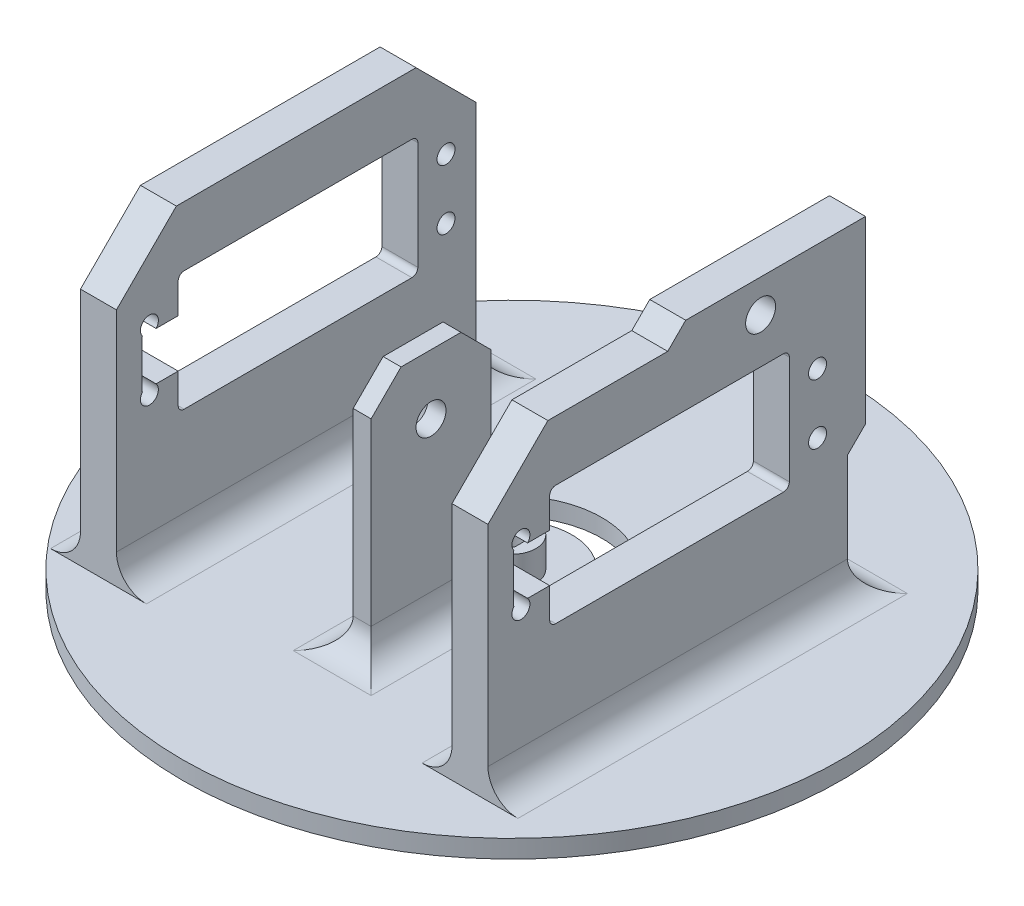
ISO-10303-21;
HEADER;
FILE_DESCRIPTION(('STEP AP214'),'2;1');
FILE_NAME('part.step','',(''),(''),'','','');
FILE_SCHEMA(('AUTOMOTIVE_DESIGN { 1 0 10303 214 1 1 1 1 }'));
ENDSEC;
DATA;
#1=APPLICATION_CONTEXT('core data for automotive mechanical design processes');
#2=APPLICATION_PROTOCOL_DEFINITION('international standard','automotive_design',2000,#1);
#3=PRODUCT_CONTEXT('',#1,'mechanical');
#4=PRODUCT('Part','Part','',(#3));
#5=PRODUCT_RELATED_PRODUCT_CATEGORY('part','',(#4));
#6=PRODUCT_DEFINITION_FORMATION('','',#4);
#7=PRODUCT_DEFINITION_CONTEXT('part definition',#1,'design');
#8=PRODUCT_DEFINITION('design','',#6,#7);
#9=PRODUCT_DEFINITION_SHAPE('','',#8);
#10=(LENGTH_UNIT() NAMED_UNIT(*) SI_UNIT(.MILLI.,.METRE.));
#11=(NAMED_UNIT(*) PLANE_ANGLE_UNIT() SI_UNIT($,.RADIAN.));
#12=(NAMED_UNIT(*) SI_UNIT($,.STERADIAN.) SOLID_ANGLE_UNIT());
#13=UNCERTAINTY_MEASURE_WITH_UNIT(LENGTH_MEASURE(1.E-05),#10,'distance_accuracy_value','');
#14=(GEOMETRIC_REPRESENTATION_CONTEXT(3) GLOBAL_UNCERTAINTY_ASSIGNED_CONTEXT((#13)) GLOBAL_UNIT_ASSIGNED_CONTEXT((#10,
#11,#12)) REPRESENTATION_CONTEXT('',''));
#15=CARTESIAN_POINT('',(0.,0.,0.));
#16=DIRECTION('',(0.,0.,1.));
#17=DIRECTION('',(1.,0.,0.));
#18=AXIS2_PLACEMENT_3D('',#15,#16,#17);
#19=CARTESIAN_POINT('',(-55.001,27.5,25.2));
#20=DIRECTION('',(0.,1.,0.));
#21=DIRECTION('',(0.,0.,1.));
#22=AXIS2_PLACEMENT_3D('',#19,#20,#21);
#23=PLANE('',#22);
#24=DIRECTION('',(1.,0.,0.));
#25=VECTOR('',#24,1.);
#26=CARTESIAN_POINT('',(-55.,27.5,31.1180339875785));
#27=LINE('',#26,#25);
#28=CARTESIAN_POINT('',(25.5,27.5,31.1180339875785));
#29=VERTEX_POINT('',#28);
#30=CARTESIAN_POINT('',(31.5,27.5,31.1180339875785));
#31=VERTEX_POINT('',#30);
#32=EDGE_CURVE('E11',#29,#31,#27,.T.);
#33=ORIENTED_EDGE('',*,*,#32,.F.);
#34=DIRECTION('',(0.,0.,-1.));
#35=VECTOR('',#34,1.);
#36=CARTESIAN_POINT('',(25.5,27.5,25.2));
#37=LINE('',#36,#35);
#38=CARTESIAN_POINT('',(25.5,27.5,31.2));
#39=VERTEX_POINT('',#38);
#40=EDGE_CURVE('E788',#39,#29,#37,.T.);
#41=ORIENTED_EDGE('',*,*,#40,.F.);
#42=DIRECTION('',(1.,0.,0.));
#43=VECTOR('',#42,1.);
#44=CARTESIAN_POINT('',(-55.001,27.5,31.2));
#45=LINE('',#44,#43);
#46=CARTESIAN_POINT('',(31.5,27.5,31.2));
#47=VERTEX_POINT('',#46);
#48=EDGE_CURVE('E762',#39,#47,#45,.T.);
#49=ORIENTED_EDGE('',*,*,#48,.T.);
#50=DIRECTION('',(0.,0.,1.));
#51=VECTOR('',#50,1.);
#52=CARTESIAN_POINT('',(31.5,27.5,25.2));
#53=LINE('',#52,#51);
#54=EDGE_CURVE('E757',#31,#47,#53,.T.);
#55=ORIENTED_EDGE('',*,*,#54,.F.);
#56=EDGE_LOOP('',(#33,#41,#49,#55));
#57=FACE_BOUND('',#56,.T.);
#58=ADVANCED_FACE('F39',(#57),#23,.T.);
#59=CARTESIAN_POINT('',(-55.001,35.5,31.2));
#60=DIRECTION('',(0.,-1.,0.));
#61=DIRECTION('',(0.,0.,-1.));
#62=AXIS2_PLACEMENT_3D('',#59,#60,#61);
#63=PLANE('',#62);
#64=DIRECTION('',(1.,0.,0.));
#65=VECTOR('',#64,1.);
#66=CARTESIAN_POINT('',(-55.,35.5,28.8819660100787));
#67=LINE('',#66,#65);
#68=CARTESIAN_POINT('',(25.5,35.5,28.8819660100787));
#69=VERTEX_POINT('',#68);
#70=CARTESIAN_POINT('',(31.5,35.5,28.8819660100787));
#71=VERTEX_POINT('',#70);
#72=EDGE_CURVE('E682',#69,#71,#67,.T.);
#73=ORIENTED_EDGE('',*,*,#72,.F.);
#74=DIRECTION('',(0.,0.,1.));
#75=VECTOR('',#74,1.);
#76=CARTESIAN_POINT('',(25.5,35.5,31.2));
#77=LINE('',#76,#75);
#78=CARTESIAN_POINT('',(25.5,35.5,25.2));
#79=VERTEX_POINT('',#78);
#80=EDGE_CURVE('E794',#79,#69,#77,.T.);
#81=ORIENTED_EDGE('',*,*,#80,.F.);
#82=DIRECTION('',(1.,0.,0.));
#83=VECTOR('',#82,1.);
#84=CARTESIAN_POINT('',(-55.001,35.5,25.2));
#85=LINE('',#84,#83);
#86=CARTESIAN_POINT('',(31.5,35.5,25.2));
#87=VERTEX_POINT('',#86);
#88=EDGE_CURVE('E716',#79,#87,#85,.T.);
#89=ORIENTED_EDGE('',*,*,#88,.T.);
#90=DIRECTION('',(0.,0.,-1.));
#91=VECTOR('',#90,1.);
#92=CARTESIAN_POINT('',(31.5,35.5,31.2));
#93=LINE('',#92,#91);
#94=EDGE_CURVE('E765',#71,#87,#93,.T.);
#95=ORIENTED_EDGE('',*,*,#94,.F.);
#96=EDGE_LOOP('',(#73,#81,#89,#95));
#97=FACE_BOUND('',#96,.T.);
#98=ADVANCED_FACE('F885',(#97),#63,.T.);
#99=CARTESIAN_POINT('',(0.,1.5,0.));
#100=DIRECTION('',(0.,1.,0.));
#101=DIRECTION('',(0.,0.,1.));
#102=AXIS2_PLACEMENT_3D('',#99,#100,#101);
#103=PLANE('',#102);
#104=DIRECTION('',(0.,0.,1.));
#105=VECTOR('',#104,1.);
#106=CARTESIAN_POINT('',(-6.5,1.5,0.));
#107=LINE('',#106,#105);
#108=CARTESIAN_POINT('',(-6.5,1.5,30.));
#109=VERTEX_POINT('',#108);
#110=CARTESIAN_POINT('',(-6.5,1.5,5.));
#111=VERTEX_POINT('',#110);
#112=EDGE_CURVE('E558',#109,#111,#107,.F.);
#113=ORIENTED_EDGE('',*,*,#112,.T.);
#114=DIRECTION('',(-1.,0.,0.));
#115=VECTOR('',#114,1.);
#116=CARTESIAN_POINT('',(-1.5,1.5,5.));
#117=LINE('',#116,#115);
#118=CARTESIAN_POINT('',(6.5,1.5,5.));
#119=VERTEX_POINT('',#118);
#120=EDGE_CURVE('E489',#119,#111,#117,.T.);
#121=ORIENTED_EDGE('',*,*,#120,.F.);
#122=DIRECTION('',(0.,0.,-1.));
#123=VECTOR('',#122,1.);
#124=CARTESIAN_POINT('',(6.5,1.5,0.));
#125=LINE('',#124,#123);
#126=CARTESIAN_POINT('',(6.5,1.5,30.));
#127=VERTEX_POINT('',#126);
#128=EDGE_CURVE('E552',#119,#127,#125,.F.);
#129=ORIENTED_EDGE('',*,*,#128,.T.);
#130=DIRECTION('',(1.,0.,0.));
#131=VECTOR('',#130,1.);
#132=CARTESIAN_POINT('',(0.,1.5,30.));
#133=LINE('',#132,#131);
#134=EDGE_CURVE('E555',#127,#109,#133,.F.);
#135=ORIENTED_EDGE('',*,*,#134,.T.);
#136=EDGE_LOOP('',(#113,#121,#129,#135));
#137=FACE_BOUND('',#136,.T.);
#138=CARTESIAN_POINT('',(0.,1.5,0.));
#139=DIRECTION('',(0.,1.,0.));
#140=DIRECTION('',(0.,0.,1.));
#141=AXIS2_PLACEMENT_3D('',#138,#139,#140);
#142=CIRCLE('',#141,55.);
#143=CARTESIAN_POINT('',(0.,1.5,55.));
#144=VERTEX_POINT('',#143);
#145=EDGE_CURVE('E544',#144,#144,#142,.T.);
#146=ORIENTED_EDGE('',*,*,#145,.T.);
#147=EDGE_LOOP('',(#146));
#148=FACE_BOUND('',#147,.T.);
#149=CARTESIAN_POINT('',(0.,1.5,0.));
#150=DIRECTION('',(0.,-1.,0.));
#151=DIRECTION('',(0.,0.,-1.));
#152=AXIS2_PLACEMENT_3D('',#149,#150,#151);
#153=CIRCLE('',#152,10.);
#154=CARTESIAN_POINT('',(-7.07106781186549,1.5,-7.07106781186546));
#155=VERTEX_POINT('',#154);
#156=CARTESIAN_POINT('',(7.07106781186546,1.5,-7.07106781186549));
#157=VERTEX_POINT('',#156);
#158=EDGE_CURVE('E516',#155,#157,#153,.T.);
#159=ORIENTED_EDGE('',*,*,#158,.F.);
#160=DIRECTION('',(0.707106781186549,0.,0.707106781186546));
#161=VECTOR('',#160,1.);
#162=CARTESIAN_POINT('',(-10.6066017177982,1.5,-10.6066017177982));
#163=LINE('',#162,#161);
#164=CARTESIAN_POINT('',(-10.6066017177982,1.5,-10.6066017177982));
#165=VERTEX_POINT('',#164);
#166=EDGE_CURVE('E506',#165,#155,#163,.T.);
#167=ORIENTED_EDGE('',*,*,#166,.F.);
#168=CARTESIAN_POINT('',(0.,1.5,0.));
#169=DIRECTION('',(0.,1.,0.));
#170=DIRECTION('',(0.,0.,-1.));
#171=AXIS2_PLACEMENT_3D('',#168,#169,#170);
#172=CIRCLE('',#171,15.);
#173=CARTESIAN_POINT('',(10.6066017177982,1.5,-10.6066017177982));
#174=VERTEX_POINT('',#173);
#175=EDGE_CURVE('E522',#174,#165,#172,.T.);
#176=ORIENTED_EDGE('',*,*,#175,.F.);
#177=DIRECTION('',(0.707106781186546,0.,-0.707106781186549));
#178=VECTOR('',#177,1.);
#179=CARTESIAN_POINT('',(7.07106781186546,1.5,-7.07106781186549));
#180=LINE('',#179,#178);
#181=EDGE_CURVE('E518',#157,#174,#180,.T.);
#182=ORIENTED_EDGE('',*,*,#181,.F.);
#183=EDGE_LOOP('',(#159,#167,#176,#182));
#184=FACE_BOUND('',#183,.T.);
#185=DIRECTION('',(-1.,0.,0.));
#186=VECTOR('',#185,1.);
#187=CARTESIAN_POINT('',(0.,1.5,-29.5));
#188=LINE('',#187,#186);
#189=CARTESIAN_POINT('',(20.5,1.5,-29.5));
#190=VERTEX_POINT('',#189);
#191=CARTESIAN_POINT('',(36.5,1.5,-29.5));
#192=VERTEX_POINT('',#191);
#193=EDGE_CURVE('E631',#190,#192,#188,.F.);
#194=ORIENTED_EDGE('',*,*,#193,.T.);
#195=DIRECTION('',(0.,0.,-1.));
#196=VECTOR('',#195,1.);
#197=CARTESIAN_POINT('',(36.5,1.5,0.));
#198=LINE('',#197,#196);
#199=CARTESIAN_POINT('',(36.5,1.5,35.5));
#200=VERTEX_POINT('',#199);
#201=EDGE_CURVE('E623',#192,#200,#198,.F.);
#202=ORIENTED_EDGE('',*,*,#201,.T.);
#203=DIRECTION('',(1.,0.,0.));
#204=VECTOR('',#203,1.);
#205=CARTESIAN_POINT('',(0.,1.5,35.5));
#206=LINE('',#205,#204);
#207=CARTESIAN_POINT('',(20.5,1.5,35.5));
#208=VERTEX_POINT('',#207);
#209=EDGE_CURVE('E835',#208,#200,#206,.T.);
#210=ORIENTED_EDGE('',*,*,#209,.F.);
#211=DIRECTION('',(0.,0.,1.));
#212=VECTOR('',#211,1.);
#213=CARTESIAN_POINT('',(20.5,1.5,0.));
#214=LINE('',#213,#212);
#215=EDGE_CURVE('E608',#208,#190,#214,.F.);
#216=ORIENTED_EDGE('',*,*,#215,.T.);
#217=EDGE_LOOP('',(#194,#202,#210,#216));
#218=FACE_BOUND('',#217,.T.);
#219=DIRECTION('',(-1.,0.,0.));
#220=VECTOR('',#219,1.);
#221=CARTESIAN_POINT('',(-36.5,1.5,-29.5));
#222=LINE('',#221,#220);
#223=CARTESIAN_POINT('',(-41.5,1.5,-29.5));
#224=VERTEX_POINT('',#223);
#225=CARTESIAN_POINT('',(-25.5,1.5,-29.5));
#226=VERTEX_POINT('',#225);
#227=EDGE_CURVE('E643',#224,#226,#222,.F.);
#228=ORIENTED_EDGE('',*,*,#227,.T.);
#229=DIRECTION('',(0.,0.,-1.));
#230=VECTOR('',#229,1.);
#231=CARTESIAN_POINT('',(-25.5,1.5,-24.5));
#232=LINE('',#231,#230);
#233=CARTESIAN_POINT('',(-25.5,1.5,35.5));
#234=VERTEX_POINT('',#233);
#235=EDGE_CURVE('E616',#226,#234,#232,.F.);
#236=ORIENTED_EDGE('',*,*,#235,.T.);
#237=DIRECTION('',(1.,0.,0.));
#238=VECTOR('',#237,1.);
#239=CARTESIAN_POINT('',(-36.5,1.5,35.5));
#240=LINE('',#239,#238);
#241=CARTESIAN_POINT('',(-41.5,1.5,35.5));
#242=VERTEX_POINT('',#241);
#243=EDGE_CURVE('E833',#242,#234,#240,.T.);
#244=ORIENTED_EDGE('',*,*,#243,.F.);
#245=DIRECTION('',(0.,0.,1.));
#246=VECTOR('',#245,1.);
#247=CARTESIAN_POINT('',(-41.5,1.5,0.));
#248=LINE('',#247,#246);
#249=EDGE_CURVE('E600',#242,#224,#248,.F.);
#250=ORIENTED_EDGE('',*,*,#249,.T.);
#251=EDGE_LOOP('',(#228,#236,#244,#250));
#252=FACE_BOUND('',#251,.T.);
#253=CARTESIAN_POINT('',(0.,1.5,0.));
#254=DIRECTION('',(0.,1.,0.));
#255=DIRECTION('',(0.,0.,1.));
#256=AXIS2_PLACEMENT_3D('',#253,#254,#255);
#257=CIRCLE('',#256,4.);
#258=CARTESIAN_POINT('',(0.,1.5,4.));
#259=VERTEX_POINT('',#258);
#260=EDGE_CURVE('E818',#259,#259,#257,.T.);
#261=ORIENTED_EDGE('',*,*,#260,.F.);
#262=EDGE_LOOP('',(#261));
#263=FACE_BOUND('',#262,.T.);
#264=ADVANCED_FACE('F868',(#137,#148,#184,#218,#252,#263),#103,.T.);
#265=CARTESIAN_POINT('',(-36.5,6.5,-29.5));
#266=DIRECTION('',(1.,0.,0.));
#267=DIRECTION('',(0.,0.,-1.));
#268=AXIS2_PLACEMENT_3D('',#265,#266,#267);
#269=CYLINDRICAL_SURFACE('',#268,5.);
#270=DIRECTION('',(-1.,0.,0.));
#271=VECTOR('',#270,1.);
#272=CARTESIAN_POINT('',(-36.5,6.5,-24.5));
#273=LINE('',#272,#271);
#274=CARTESIAN_POINT('',(-30.5,6.5,-24.5));
#275=VERTEX_POINT('',#274);
#276=CARTESIAN_POINT('',(-36.5,6.5,-24.5));
#277=VERTEX_POINT('',#276);
#278=EDGE_CURVE('E640',#275,#277,#273,.T.);
#279=ORIENTED_EDGE('',*,*,#278,.F.);
#280=CARTESIAN_POINT('',(-25.5,6.5,-29.5));
#281=DIRECTION('',(0.707106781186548,0.,0.707106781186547));
#282=DIRECTION('',(-0.707106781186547,0.,0.707106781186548));
#283=AXIS2_PLACEMENT_3D('',#280,#281,#282);
#284=ELLIPSE('',#283,7.07106781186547,5.);
#285=EDGE_CURVE('E646',#275,#226,#284,.T.);
#286=ORIENTED_EDGE('',*,*,#285,.T.);
#287=ORIENTED_EDGE('',*,*,#227,.F.);
#288=CARTESIAN_POINT('',(-41.5,6.5,-29.5));
#289=DIRECTION('',(-0.707106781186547,0.,0.707106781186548));
#290=DIRECTION('',(0.707106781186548,0.,0.707106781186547));
#291=AXIS2_PLACEMENT_3D('',#288,#289,#290);
#292=ELLIPSE('',#291,7.07106781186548,5.);
#293=EDGE_CURVE('E649',#224,#277,#292,.T.);
#294=ORIENTED_EDGE('',*,*,#293,.T.);
#295=EDGE_LOOP('',(#279,#286,#287,#294));
#296=FACE_BOUND('',#295,.T.);
#297=ADVANCED_FACE('F882',(#296),#269,.F.);
#298=CARTESIAN_POINT('',(0.,6.5,-29.5));
#299=DIRECTION('',(1.,0.,0.));
#300=DIRECTION('',(0.,0.,-1.));
#301=AXIS2_PLACEMENT_3D('',#298,#299,#300);
#302=CYLINDRICAL_SURFACE('',#301,5.);
#303=DIRECTION('',(-1.,0.,0.));
#304=VECTOR('',#303,1.);
#305=CARTESIAN_POINT('',(0.,6.5,-24.5));
#306=LINE('',#305,#304);
#307=CARTESIAN_POINT('',(31.5,6.5,-24.5));
#308=VERTEX_POINT('',#307);
#309=CARTESIAN_POINT('',(25.5,6.5,-24.5));
#310=VERTEX_POINT('',#309);
#311=EDGE_CURVE('E629',#308,#310,#306,.T.);
#312=ORIENTED_EDGE('',*,*,#311,.F.);
#313=CARTESIAN_POINT('',(36.5,6.5,-29.5));
#314=DIRECTION('',(0.707106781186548,0.,0.707106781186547));
#315=DIRECTION('',(-0.707106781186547,0.,0.707106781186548));
#316=AXIS2_PLACEMENT_3D('',#313,#314,#315);
#317=ELLIPSE('',#316,7.07106781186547,5.);
#318=EDGE_CURVE('E634',#308,#192,#317,.T.);
#319=ORIENTED_EDGE('',*,*,#318,.T.);
#320=ORIENTED_EDGE('',*,*,#193,.F.);
#321=CARTESIAN_POINT('',(20.5,6.5,-29.5));
#322=DIRECTION('',(-0.707106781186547,0.,0.707106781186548));
#323=DIRECTION('',(0.707106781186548,0.,0.707106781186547));
#324=AXIS2_PLACEMENT_3D('',#321,#322,#323);
#325=ELLIPSE('',#324,7.07106781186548,5.);
#326=EDGE_CURVE('E637',#190,#310,#325,.T.);
#327=ORIENTED_EDGE('',*,*,#326,.T.);
#328=EDGE_LOOP('',(#312,#319,#320,#327));
#329=FACE_BOUND('',#328,.T.);
#330=ADVANCED_FACE('F866',(#329),#302,.F.);
#331=CARTESIAN_POINT('',(36.5,6.5,0.));
#332=DIRECTION('',(0.,0.,1.));
#333=DIRECTION('',(1.,0.,0.));
#334=AXIS2_PLACEMENT_3D('',#331,#332,#333);
#335=CYLINDRICAL_SURFACE('',#334,5.);
#336=DIRECTION('',(0.,0.,-1.));
#337=VECTOR('',#336,1.);
#338=CARTESIAN_POINT('',(31.5,6.5,0.));
#339=LINE('',#338,#337);
#340=CARTESIAN_POINT('',(31.5,6.5,35.5));
#341=VERTEX_POINT('',#340);
#342=EDGE_CURVE('E475',#341,#308,#339,.T.);
#343=ORIENTED_EDGE('',*,*,#342,.F.);
#344=CARTESIAN_POINT('',(36.5,6.5,35.5));
#345=DIRECTION('',(0.,0.,-1.));
#346=DIRECTION('',(-1.,0.,0.));
#347=AXIS2_PLACEMENT_3D('',#344,#345,#346);
#348=CIRCLE('',#347,5.);
#349=EDGE_CURVE('E626',#341,#200,#348,.F.);
#350=ORIENTED_EDGE('',*,*,#349,.T.);
#351=ORIENTED_EDGE('',*,*,#201,.F.);
#352=ORIENTED_EDGE('',*,*,#318,.F.);
#353=EDGE_LOOP('',(#343,#350,#351,#352));
#354=FACE_BOUND('',#353,.T.);
#355=ADVANCED_FACE('F872',(#354),#335,.F.);
#356=CARTESIAN_POINT('',(-25.5,6.5,-24.5));
#357=DIRECTION('',(0.,0.,1.));
#358=DIRECTION('',(1.,0.,0.));
#359=AXIS2_PLACEMENT_3D('',#356,#357,#358);
#360=CYLINDRICAL_SURFACE('',#359,5.);
#361=DIRECTION('',(0.,0.,-1.));
#362=VECTOR('',#361,1.);
#363=CARTESIAN_POINT('',(-30.5,6.5,-24.5));
#364=LINE('',#363,#362);
#365=CARTESIAN_POINT('',(-30.5,6.5,35.5));
#366=VERTEX_POINT('',#365);
#367=EDGE_CURVE('E613',#366,#275,#364,.T.);
#368=ORIENTED_EDGE('',*,*,#367,.F.);
#369=CARTESIAN_POINT('',(-25.5,6.5,35.5));
#370=DIRECTION('',(0.,0.,-1.));
#371=DIRECTION('',(-1.,0.,0.));
#372=AXIS2_PLACEMENT_3D('',#369,#370,#371);
#373=CIRCLE('',#372,5.);
#374=EDGE_CURVE('E619',#366,#234,#373,.F.);
#375=ORIENTED_EDGE('',*,*,#374,.T.);
#376=ORIENTED_EDGE('',*,*,#235,.F.);
#377=ORIENTED_EDGE('',*,*,#285,.F.);
#378=EDGE_LOOP('',(#368,#375,#376,#377));
#379=FACE_BOUND('',#378,.T.);
#380=ADVANCED_FACE('F874',(#379),#360,.F.);
#381=CARTESIAN_POINT('',(20.5,6.5,0.));
#382=DIRECTION('',(0.,0.,1.));
#383=DIRECTION('',(1.,0.,0.));
#384=AXIS2_PLACEMENT_3D('',#381,#382,#383);
#385=CYLINDRICAL_SURFACE('',#384,5.);
#386=DIRECTION('',(0.,0.,1.));
#387=VECTOR('',#386,1.);
#388=CARTESIAN_POINT('',(25.5,6.5,0.));
#389=LINE('',#388,#387);
#390=CARTESIAN_POINT('',(25.5,6.5,35.5));
#391=VERTEX_POINT('',#390);
#392=EDGE_CURVE('E605',#310,#391,#389,.T.);
#393=ORIENTED_EDGE('',*,*,#392,.F.);
#394=ORIENTED_EDGE('',*,*,#326,.F.);
#395=ORIENTED_EDGE('',*,*,#215,.F.);
#396=CARTESIAN_POINT('',(20.5,6.5,35.5));
#397=DIRECTION('',(0.,0.,-1.));
#398=DIRECTION('',(-1.,0.,0.));
#399=AXIS2_PLACEMENT_3D('',#396,#397,#398);
#400=CIRCLE('',#399,5.);
#401=EDGE_CURVE('E610',#208,#391,#400,.F.);
#402=ORIENTED_EDGE('',*,*,#401,.T.);
#403=EDGE_LOOP('',(#393,#394,#395,#402));
#404=FACE_BOUND('',#403,.T.);
#405=ADVANCED_FACE('F858',(#404),#385,.F.);
#406=CARTESIAN_POINT('',(-41.5,6.5,-24.5));
#407=DIRECTION('',(0.,0.,1.));
#408=DIRECTION('',(1.,0.,0.));
#409=AXIS2_PLACEMENT_3D('',#406,#407,#408);
#410=CYLINDRICAL_SURFACE('',#409,5.);
#411=DIRECTION('',(0.,0.,1.));
#412=VECTOR('',#411,1.);
#413=CARTESIAN_POINT('',(-36.5,6.5,-24.5));
#414=LINE('',#413,#412);
#415=CARTESIAN_POINT('',(-36.5,6.5,35.5));
#416=VERTEX_POINT('',#415);
#417=EDGE_CURVE('E595',#277,#416,#414,.T.);
#418=ORIENTED_EDGE('',*,*,#417,.F.);
#419=ORIENTED_EDGE('',*,*,#293,.F.);
#420=ORIENTED_EDGE('',*,*,#249,.F.);
#421=CARTESIAN_POINT('',(-41.5,6.5,35.5));
#422=DIRECTION('',(0.,0.,-1.));
#423=DIRECTION('',(-1.,0.,0.));
#424=AXIS2_PLACEMENT_3D('',#421,#422,#423);
#425=CIRCLE('',#424,5.);
#426=EDGE_CURVE('E602',#242,#416,#425,.F.);
#427=ORIENTED_EDGE('',*,*,#426,.T.);
#428=EDGE_LOOP('',(#418,#419,#420,#427));
#429=FACE_BOUND('',#428,.T.);
#430=ADVANCED_FACE('F1158',(#429),#410,.F.);
#431=CARTESIAN_POINT('',(-1.5,6.5,30.));
#432=DIRECTION('',(1.,0.,0.));
#433=DIRECTION('',(0.,0.,-1.));
#434=AXIS2_PLACEMENT_3D('',#431,#432,#433);
#435=CYLINDRICAL_SURFACE('',#434,5.);
#436=CARTESIAN_POINT('',(6.5,6.5,30.));
#437=DIRECTION('',(0.707106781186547,0.,-0.707106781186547));
#438=DIRECTION('',(-0.707106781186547,0.,-0.707106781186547));
#439=AXIS2_PLACEMENT_3D('',#436,#437,#438);
#440=ELLIPSE('',#439,7.07106781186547,5.);
#441=CARTESIAN_POINT('',(1.5,6.5,25.));
#442=VERTEX_POINT('',#441);
#443=EDGE_CURVE('E572',#442,#127,#440,.F.);
#444=ORIENTED_EDGE('',*,*,#443,.F.);
#445=DIRECTION('',(1.,0.,0.));
#446=VECTOR('',#445,1.);
#447=CARTESIAN_POINT('',(-1.5,6.5,25.));
#448=LINE('',#447,#446);
#449=CARTESIAN_POINT('',(-1.5,6.5,25.));
#450=VERTEX_POINT('',#449);
#451=EDGE_CURVE('E561',#450,#442,#448,.T.);
#452=ORIENTED_EDGE('',*,*,#451,.F.);
#453=CARTESIAN_POINT('',(-6.5,6.5,30.));
#454=DIRECTION('',(0.707106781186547,0.,0.707106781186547));
#455=DIRECTION('',(0.707106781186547,0.,-0.707106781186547));
#456=AXIS2_PLACEMENT_3D('',#453,#454,#455);
#457=ELLIPSE('',#456,7.07106781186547,5.);
#458=EDGE_CURVE('E570',#450,#109,#457,.F.);
#459=ORIENTED_EDGE('',*,*,#458,.T.);
#460=ORIENTED_EDGE('',*,*,#134,.F.);
#461=EDGE_LOOP('',(#444,#452,#459,#460));
#462=FACE_BOUND('',#461,.T.);
#463=ADVANCED_FACE('F1154',(#462),#435,.F.);
#464=CARTESIAN_POINT('',(-6.5,6.5,25.));
#465=DIRECTION('',(0.,0.,1.));
#466=DIRECTION('',(1.,0.,0.));
#467=AXIS2_PLACEMENT_3D('',#464,#465,#466);
#468=CYLINDRICAL_SURFACE('',#467,5.);
#469=ORIENTED_EDGE('',*,*,#458,.F.);
#470=DIRECTION('',(0.,0.,1.));
#471=VECTOR('',#470,1.);
#472=CARTESIAN_POINT('',(-1.5,6.5,25.));
#473=LINE('',#472,#471);
#474=CARTESIAN_POINT('',(-1.5,6.5,5.));
#475=VERTEX_POINT('',#474);
#476=EDGE_CURVE('E547',#475,#450,#473,.T.);
#477=ORIENTED_EDGE('',*,*,#476,.F.);
#478=CARTESIAN_POINT('',(-6.5,6.5,5.));
#479=DIRECTION('',(0.,0.,1.));
#480=DIRECTION('',(1.,0.,0.));
#481=AXIS2_PLACEMENT_3D('',#478,#479,#480);
#482=CIRCLE('',#481,5.);
#483=EDGE_CURVE('E567',#475,#111,#482,.F.);
#484=ORIENTED_EDGE('',*,*,#483,.T.);
#485=ORIENTED_EDGE('',*,*,#112,.F.);
#486=EDGE_LOOP('',(#469,#477,#484,#485));
#487=FACE_BOUND('',#486,.T.);
#488=ADVANCED_FACE('F1151',(#487),#468,.F.);
#489=CARTESIAN_POINT('',(6.5,6.5,25.));
#490=DIRECTION('',(0.,0.,-1.));
#491=DIRECTION('',(-1.,0.,0.));
#492=AXIS2_PLACEMENT_3D('',#489,#490,#491);
#493=CYLINDRICAL_SURFACE('',#492,5.);
#494=DIRECTION('',(0.,0.,-1.));
#495=VECTOR('',#494,1.);
#496=CARTESIAN_POINT('',(1.5,6.5,25.));
#497=LINE('',#496,#495);
#498=CARTESIAN_POINT('',(1.5,6.5,5.));
#499=VERTEX_POINT('',#498);
#500=EDGE_CURVE('E564',#442,#499,#497,.T.);
#501=ORIENTED_EDGE('',*,*,#500,.F.);
#502=ORIENTED_EDGE('',*,*,#443,.T.);
#503=ORIENTED_EDGE('',*,*,#128,.F.);
#504=CARTESIAN_POINT('',(6.5,6.5,5.));
#505=DIRECTION('',(0.,0.,1.));
#506=DIRECTION('',(1.,0.,0.));
#507=AXIS2_PLACEMENT_3D('',#504,#505,#506);
#508=CIRCLE('',#507,5.);
#509=EDGE_CURVE('E574',#119,#499,#508,.F.);
#510=ORIENTED_EDGE('',*,*,#509,.T.);
#511=EDGE_LOOP('',(#501,#502,#503,#510));
#512=FACE_BOUND('',#511,.T.);
#513=ADVANCED_FACE('F1149',(#512),#493,.F.);
#514=CARTESIAN_POINT('',(0.,1.5,0.));
#515=DIRECTION('',(0.,-1.,0.));
#516=DIRECTION('',(0.,0.,-1.));
#517=AXIS2_PLACEMENT_3D('',#514,#515,#516);
#518=CYLINDRICAL_SURFACE('',#517,55.);
#519=ORIENTED_EDGE('',*,*,#145,.F.);
#520=EDGE_LOOP('',(#519));
#521=FACE_BOUND('',#520,.T.);
#522=CARTESIAN_POINT('',(0.,-1.5,0.));
#523=DIRECTION('',(0.,1.,0.));
#524=DIRECTION('',(0.,0.,1.));
#525=AXIS2_PLACEMENT_3D('',#522,#523,#524);
#526=CIRCLE('',#525,55.);
#527=CARTESIAN_POINT('',(0.,-1.5,55.));
#528=VERTEX_POINT('',#527);
#529=EDGE_CURVE('E529',#528,#528,#526,.T.);
#530=ORIENTED_EDGE('',*,*,#529,.T.);
#531=EDGE_LOOP('',(#530));
#532=FACE_BOUND('',#531,.T.);
#533=ADVANCED_FACE('F1145',(#521,#532),#518,.T.);
#534=CARTESIAN_POINT('',(0.,-1.5,0.));
#535=DIRECTION('',(0.,1.,0.));
#536=DIRECTION('',(0.,0.,1.));
#537=AXIS2_PLACEMENT_3D('',#534,#535,#536);
#538=PLANE('',#537);
#539=DIRECTION('',(0.707106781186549,0.,0.707106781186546));
#540=VECTOR('',#539,1.);
#541=CARTESIAN_POINT('',(-10.6066017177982,-1.5,-10.6066017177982));
#542=LINE('',#541,#540);
#543=CARTESIAN_POINT('',(-10.6066017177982,-1.5,-10.6066017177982));
#544=VERTEX_POINT('',#543);
#545=CARTESIAN_POINT('',(-7.07106781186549,-1.5,-7.07106781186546));
#546=VERTEX_POINT('',#545);
#547=EDGE_CURVE('E512',#544,#546,#542,.T.);
#548=ORIENTED_EDGE('',*,*,#547,.T.);
#549=CARTESIAN_POINT('',(0.,-1.5,0.));
#550=DIRECTION('',(0.,-1.,0.));
#551=DIRECTION('',(0.,0.,-1.));
#552=AXIS2_PLACEMENT_3D('',#549,#550,#551);
#553=CIRCLE('',#552,10.);
#554=CARTESIAN_POINT('',(7.07106781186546,-1.5,-7.07106781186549));
#555=VERTEX_POINT('',#554);
#556=EDGE_CURVE('E502',#546,#555,#553,.T.);
#557=ORIENTED_EDGE('',*,*,#556,.T.);
#558=DIRECTION('',(0.707106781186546,0.,-0.707106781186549));
#559=VECTOR('',#558,1.);
#560=CARTESIAN_POINT('',(7.07106781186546,-1.5,-7.07106781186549));
#561=LINE('',#560,#559);
#562=CARTESIAN_POINT('',(10.6066017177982,-1.5,-10.6066017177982));
#563=VERTEX_POINT('',#562);
#564=EDGE_CURVE('E505',#555,#563,#561,.T.);
#565=ORIENTED_EDGE('',*,*,#564,.T.);
#566=CARTESIAN_POINT('',(0.,-1.5,0.));
#567=DIRECTION('',(0.,1.,0.));
#568=DIRECTION('',(0.,0.,-1.));
#569=AXIS2_PLACEMENT_3D('',#566,#567,#568);
#570=CIRCLE('',#569,15.);
#571=EDGE_CURVE('E509',#563,#544,#570,.T.);
#572=ORIENTED_EDGE('',*,*,#571,.T.);
#573=EDGE_LOOP('',(#548,#557,#565,#572));
#574=FACE_BOUND('',#573,.T.);
#575=DIRECTION('',(0.,0.,-1.));
#576=VECTOR('',#575,1.);
#577=CARTESIAN_POINT('',(2.00000000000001,-1.5,-1.5));
#578=LINE('',#577,#576);
#579=CARTESIAN_POINT('',(2.00000000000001,-1.5,1.5));
#580=VERTEX_POINT('',#579);
#581=CARTESIAN_POINT('',(2.00000000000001,-1.5,-1.5));
#582=VERTEX_POINT('',#581);
#583=EDGE_CURVE('E538',#580,#582,#578,.T.);
#584=ORIENTED_EDGE('',*,*,#583,.T.);
#585=CARTESIAN_POINT('',(0.,-1.5,0.));
#586=DIRECTION('',(0.,1.,0.));
#587=DIRECTION('',(0.,0.,1.));
#588=AXIS2_PLACEMENT_3D('',#585,#586,#587);
#589=CIRCLE('',#588,2.5);
#590=EDGE_CURVE('E519',#582,#580,#589,.T.);
#591=ORIENTED_EDGE('',*,*,#590,.T.);
#592=EDGE_LOOP('',(#584,#591));
#593=FACE_BOUND('',#592,.T.);
#594=ORIENTED_EDGE('',*,*,#529,.F.);
#595=EDGE_LOOP('',(#594));
#596=FACE_BOUND('',#595,.T.);
#597=ADVANCED_FACE('F1135',(#574,#593,#596),#538,.F.);
#598=CARTESIAN_POINT('',(0.,-1.5,0.));
#599=DIRECTION('',(0.,1.,0.));
#600=DIRECTION('',(0.,0.,1.));
#601=AXIS2_PLACEMENT_3D('',#598,#599,#600);
#602=CYLINDRICAL_SURFACE('',#601,2.5);
#603=DIRECTION('',(0.,1.,0.));
#604=VECTOR('',#603,1.);
#605=CARTESIAN_POINT('',(2.00000000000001,-1.5,-1.5));
#606=LINE('',#605,#604);
#607=CARTESIAN_POINT('',(2.00000000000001,6.5,-1.5));
#608=VERTEX_POINT('',#607);
#609=EDGE_CURVE('E501',#582,#608,#606,.T.);
#610=ORIENTED_EDGE('',*,*,#609,.T.);
#611=CARTESIAN_POINT('',(0.,6.5,0.));
#612=DIRECTION('',(0.,1.,0.));
#613=DIRECTION('',(0.,0.,1.));
#614=AXIS2_PLACEMENT_3D('',#611,#612,#613);
#615=CIRCLE('',#614,2.5);
#616=CARTESIAN_POINT('',(2.00000000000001,6.5,1.5));
#617=VERTEX_POINT('',#616);
#618=EDGE_CURVE('E780',#608,#617,#615,.T.);
#619=ORIENTED_EDGE('',*,*,#618,.T.);
#620=DIRECTION('',(0.,1.,0.));
#621=VECTOR('',#620,1.);
#622=CARTESIAN_POINT('',(2.00000000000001,-1.5,1.5));
#623=LINE('',#622,#621);
#624=EDGE_CURVE('E536',#580,#617,#623,.T.);
#625=ORIENTED_EDGE('',*,*,#624,.F.);
#626=ORIENTED_EDGE('',*,*,#590,.F.);
#627=EDGE_LOOP('',(#610,#619,#625,#626));
#628=FACE_BOUND('',#627,.T.);
#629=ADVANCED_FACE('F1132',(#628),#602,.F.);
#630=CARTESIAN_POINT('',(2.00000000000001,-1.5,-1.5));
#631=DIRECTION('',(1.,0.,0.));
#632=DIRECTION('',(0.,0.,-1.));
#633=AXIS2_PLACEMENT_3D('',#630,#631,#632);
#634=PLANE('',#633);
#635=ORIENTED_EDGE('',*,*,#624,.T.);
#636=DIRECTION('',(0.,0.,-1.));
#637=VECTOR('',#636,1.);
#638=CARTESIAN_POINT('',(2.00000000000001,6.5,1.5));
#639=LINE('',#638,#637);
#640=EDGE_CURVE('E815',#617,#608,#639,.T.);
#641=ORIENTED_EDGE('',*,*,#640,.T.);
#642=ORIENTED_EDGE('',*,*,#609,.F.);
#643=ORIENTED_EDGE('',*,*,#583,.F.);
#644=EDGE_LOOP('',(#635,#641,#642,#643));
#645=FACE_BOUND('',#644,.T.);
#646=ADVANCED_FACE('F1130',(#645),#634,.F.);
#647=CARTESIAN_POINT('',(0.,-1.5,0.));
#648=DIRECTION('',(0.,1.,0.));
#649=DIRECTION('',(0.,0.,1.));
#650=AXIS2_PLACEMENT_3D('',#647,#648,#649);
#651=CYLINDRICAL_SURFACE('',#650,10.);
#652=ORIENTED_EDGE('',*,*,#158,.T.);
#653=DIRECTION('',(0.,1.,0.));
#654=VECTOR('',#653,1.);
#655=CARTESIAN_POINT('',(7.07106781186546,-1.5,-7.07106781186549));
#656=LINE('',#655,#654);
#657=EDGE_CURVE('E515',#555,#157,#656,.T.);
#658=ORIENTED_EDGE('',*,*,#657,.F.);
#659=ORIENTED_EDGE('',*,*,#556,.F.);
#660=DIRECTION('',(0.,1.,0.));
#661=VECTOR('',#660,1.);
#662=CARTESIAN_POINT('',(-7.07106781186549,-1.5,-7.07106781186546));
#663=LINE('',#662,#661);
#664=EDGE_CURVE('E527',#546,#155,#663,.T.);
#665=ORIENTED_EDGE('',*,*,#664,.T.);
#666=EDGE_LOOP('',(#652,#658,#659,#665));
#667=FACE_BOUND('',#666,.T.);
#668=ADVANCED_FACE('F1120',(#667),#651,.T.);
#669=CARTESIAN_POINT('',(-10.6066017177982,-1.5,-10.6066017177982));
#670=DIRECTION('',(-0.707106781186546,0.,0.707106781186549));
#671=DIRECTION('',(0.707106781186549,0.,0.707106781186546));
#672=AXIS2_PLACEMENT_3D('',#669,#670,#671);
#673=PLANE('',#672);
#674=ORIENTED_EDGE('',*,*,#166,.T.);
#675=ORIENTED_EDGE('',*,*,#664,.F.);
#676=ORIENTED_EDGE('',*,*,#547,.F.);
#677=DIRECTION('',(0.,1.,0.));
#678=VECTOR('',#677,1.);
#679=CARTESIAN_POINT('',(-10.6066017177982,-1.5,-10.6066017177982));
#680=LINE('',#679,#678);
#681=EDGE_CURVE('E530',#544,#165,#680,.T.);
#682=ORIENTED_EDGE('',*,*,#681,.T.);
#683=EDGE_LOOP('',(#674,#675,#676,#682));
#684=FACE_BOUND('',#683,.T.);
#685=ADVANCED_FACE('F1116',(#684),#673,.F.);
#686=CARTESIAN_POINT('',(0.,-1.5,0.));
#687=DIRECTION('',(0.,1.,0.));
#688=DIRECTION('',(0.,0.,1.));
#689=AXIS2_PLACEMENT_3D('',#686,#687,#688);
#690=CYLINDRICAL_SURFACE('',#689,15.);
#691=ORIENTED_EDGE('',*,*,#175,.T.);
#692=ORIENTED_EDGE('',*,*,#681,.F.);
#693=ORIENTED_EDGE('',*,*,#571,.F.);
#694=DIRECTION('',(0.,1.,0.));
#695=VECTOR('',#694,1.);
#696=CARTESIAN_POINT('',(10.6066017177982,-1.5,-10.6066017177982));
#697=LINE('',#696,#695);
#698=EDGE_CURVE('E532',#563,#174,#697,.T.);
#699=ORIENTED_EDGE('',*,*,#698,.T.);
#700=EDGE_LOOP('',(#691,#692,#693,#699));
#701=FACE_BOUND('',#700,.T.);
#702=ADVANCED_FACE('F1119',(#701),#690,.F.);
#703=CARTESIAN_POINT('',(7.07106781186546,-1.5,-7.07106781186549));
#704=DIRECTION('',(0.707106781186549,0.,0.707106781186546));
#705=DIRECTION('',(0.707106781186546,0.,-0.707106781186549));
#706=AXIS2_PLACEMENT_3D('',#703,#704,#705);
#707=PLANE('',#706);
#708=ORIENTED_EDGE('',*,*,#181,.T.);
#709=ORIENTED_EDGE('',*,*,#698,.F.);
#710=ORIENTED_EDGE('',*,*,#564,.F.);
#711=ORIENTED_EDGE('',*,*,#657,.T.);
#712=EDGE_LOOP('',(#708,#709,#710,#711));
#713=FACE_BOUND('',#712,.T.);
#714=ADVANCED_FACE('F1114',(#713),#707,.F.);
#715=CARTESIAN_POINT('',(1.5,41.5,25.));
#716=DIRECTION('',(-1.,0.,0.));
#717=DIRECTION('',(0.,0.,1.));
#718=AXIS2_PLACEMENT_3D('',#715,#716,#717);
#719=PLANE('',#718);
#720=CARTESIAN_POINT('',(1.5,31.5,15.));
#721=DIRECTION('',(1.,0.,0.));
#722=DIRECTION('',(0.,0.,-1.));
#723=AXIS2_PLACEMENT_3D('',#720,#721,#722);
#724=CIRCLE('',#723,2.5);
#725=CARTESIAN_POINT('',(1.5,31.5,12.5));
#726=VERTEX_POINT('',#725);
#727=EDGE_CURVE('E476',#726,#726,#724,.T.);
#728=ORIENTED_EDGE('',*,*,#727,.F.);
#729=EDGE_LOOP('',(#728));
#730=FACE_BOUND('',#729,.T.);
#731=DIRECTION('',(0.,-1.,0.));
#732=VECTOR('',#731,1.);
#733=CARTESIAN_POINT('',(1.5,41.5,5.));
#734=LINE('',#733,#732);
#735=CARTESIAN_POINT('',(1.5,36.5,5.));
#736=VERTEX_POINT('',#735);
#737=EDGE_CURVE('E499',#736,#499,#734,.T.);
#738=ORIENTED_EDGE('',*,*,#737,.F.);
#739=DIRECTION('',(0.,-0.707106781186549,-0.707106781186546));
#740=VECTOR('',#739,1.);
#741=CARTESIAN_POINT('',(1.5,41.5,9.99999999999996));
#742=LINE('',#741,#740);
#743=CARTESIAN_POINT('',(1.5,41.5,9.99999999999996));
#744=VERTEX_POINT('',#743);
#745=EDGE_CURVE('E591',#736,#744,#742,.F.);
#746=ORIENTED_EDGE('',*,*,#745,.T.);
#747=DIRECTION('',(0.,0.,-1.));
#748=VECTOR('',#747,1.);
#749=CARTESIAN_POINT('',(1.5,41.5,25.));
#750=LINE('',#749,#748);
#751=CARTESIAN_POINT('',(1.5,41.5,20.));
#752=VERTEX_POINT('',#751);
#753=EDGE_CURVE('E485',#752,#744,#750,.T.);
#754=ORIENTED_EDGE('',*,*,#753,.F.);
#755=DIRECTION('',(0.,0.707106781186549,-0.707106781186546));
#756=VECTOR('',#755,1.);
#757=CARTESIAN_POINT('',(1.5,41.5,20.));
#758=LINE('',#757,#756);
#759=CARTESIAN_POINT('',(1.5,36.5,25.));
#760=VERTEX_POINT('',#759);
#761=EDGE_CURVE('E589',#752,#760,#758,.F.);
#762=ORIENTED_EDGE('',*,*,#761,.T.);
#763=DIRECTION('',(0.,-1.,0.));
#764=VECTOR('',#763,1.);
#765=CARTESIAN_POINT('',(1.5,41.5,25.));
#766=LINE('',#765,#764);
#767=EDGE_CURVE('E492',#760,#442,#766,.T.);
#768=ORIENTED_EDGE('',*,*,#767,.T.);
#769=ORIENTED_EDGE('',*,*,#500,.T.);
#770=EDGE_LOOP('',(#738,#746,#754,#762,#768,#769));
#771=FACE_BOUND('',#770,.T.);
#772=ADVANCED_FACE('F1110',(#730,#771),#719,.F.);
#773=CARTESIAN_POINT('',(-1.5,41.5,5.));
#774=DIRECTION('',(0.,0.,1.));
#775=DIRECTION('',(1.,0.,0.));
#776=AXIS2_PLACEMENT_3D('',#773,#774,#775);
#777=PLANE('',#776);
#778=DIRECTION('',(0.,-1.,0.));
#779=VECTOR('',#778,1.);
#780=CARTESIAN_POINT('',(-1.5,41.5,5.));
#781=LINE('',#780,#779);
#782=CARTESIAN_POINT('',(-1.5,36.5,5.));
#783=VERTEX_POINT('',#782);
#784=EDGE_CURVE('E497',#783,#475,#781,.T.);
#785=ORIENTED_EDGE('',*,*,#784,.F.);
#786=DIRECTION('',(1.,0.,0.));
#787=VECTOR('',#786,1.);
#788=CARTESIAN_POINT('',(-1.5,36.5,5.));
#789=LINE('',#788,#787);
#790=EDGE_CURVE('E587',#783,#736,#789,.T.);
#791=ORIENTED_EDGE('',*,*,#790,.T.);
#792=ORIENTED_EDGE('',*,*,#737,.T.);
#793=ORIENTED_EDGE('',*,*,#509,.F.);
#794=ORIENTED_EDGE('',*,*,#120,.T.);
#795=ORIENTED_EDGE('',*,*,#483,.F.);
#796=EDGE_LOOP('',(#785,#791,#792,#793,#794,#795));
#797=FACE_BOUND('',#796,.T.);
#798=ADVANCED_FACE('F1106',(#797),#777,.F.);
#799=CARTESIAN_POINT('',(-1.5,41.5,25.));
#800=DIRECTION('',(1.,0.,0.));
#801=DIRECTION('',(0.,0.,-1.));
#802=AXIS2_PLACEMENT_3D('',#799,#800,#801);
#803=PLANE('',#802);
#804=CARTESIAN_POINT('',(-1.5,31.5,15.));
#805=DIRECTION('',(1.,0.,0.));
#806=DIRECTION('',(0.,0.,-1.));
#807=AXIS2_PLACEMENT_3D('',#804,#805,#806);
#808=CIRCLE('',#807,2.5);
#809=CARTESIAN_POINT('',(-1.5,31.5,12.5));
#810=VERTEX_POINT('',#809);
#811=EDGE_CURVE('E479',#810,#810,#808,.T.);
#812=ORIENTED_EDGE('',*,*,#811,.T.);
#813=EDGE_LOOP('',(#812));
#814=FACE_BOUND('',#813,.T.);
#815=DIRECTION('',(0.,0.,1.));
#816=VECTOR('',#815,1.);
#817=CARTESIAN_POINT('',(-1.5,41.5,25.));
#818=LINE('',#817,#816);
#819=CARTESIAN_POINT('',(-1.5,41.5,9.99999999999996));
#820=VERTEX_POINT('',#819);
#821=CARTESIAN_POINT('',(-1.5,41.5,20.));
#822=VERTEX_POINT('',#821);
#823=EDGE_CURVE('E488',#820,#822,#818,.T.);
#824=ORIENTED_EDGE('',*,*,#823,.F.);
#825=DIRECTION('',(0.,0.707106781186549,0.707106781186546));
#826=VECTOR('',#825,1.);
#827=CARTESIAN_POINT('',(-1.5,41.5,9.99999999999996));
#828=LINE('',#827,#826);
#829=EDGE_CURVE('E585',#820,#783,#828,.F.);
#830=ORIENTED_EDGE('',*,*,#829,.T.);
#831=ORIENTED_EDGE('',*,*,#784,.T.);
#832=ORIENTED_EDGE('',*,*,#476,.T.);
#833=DIRECTION('',(0.,-1.,0.));
#834=VECTOR('',#833,1.);
#835=CARTESIAN_POINT('',(-1.5,41.5,25.));
#836=LINE('',#835,#834);
#837=CARTESIAN_POINT('',(-1.5,36.5,25.));
#838=VERTEX_POINT('',#837);
#839=EDGE_CURVE('E495',#838,#450,#836,.T.);
#840=ORIENTED_EDGE('',*,*,#839,.F.);
#841=DIRECTION('',(0.,-0.707106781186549,0.707106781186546));
#842=VECTOR('',#841,1.);
#843=CARTESIAN_POINT('',(-1.5,41.5,20.));
#844=LINE('',#843,#842);
#845=EDGE_CURVE('E583',#838,#822,#844,.F.);
#846=ORIENTED_EDGE('',*,*,#845,.T.);
#847=EDGE_LOOP('',(#824,#830,#831,#832,#840,#846));
#848=FACE_BOUND('',#847,.T.);
#849=ADVANCED_FACE('F1102',(#814,#848),#803,.F.);
#850=CARTESIAN_POINT('',(-1.5,41.5,25.));
#851=DIRECTION('',(0.,0.,-1.));
#852=DIRECTION('',(-1.,0.,0.));
#853=AXIS2_PLACEMENT_3D('',#850,#851,#852);
#854=PLANE('',#853);
#855=ORIENTED_EDGE('',*,*,#767,.F.);
#856=DIRECTION('',(-1.,0.,0.));
#857=VECTOR('',#856,1.);
#858=CARTESIAN_POINT('',(-1.5,36.5,25.));
#859=LINE('',#858,#857);
#860=EDGE_CURVE('E593',#760,#838,#859,.T.);
#861=ORIENTED_EDGE('',*,*,#860,.T.);
#862=ORIENTED_EDGE('',*,*,#839,.T.);
#863=ORIENTED_EDGE('',*,*,#451,.T.);
#864=EDGE_LOOP('',(#855,#861,#862,#863));
#865=FACE_BOUND('',#864,.T.);
#866=ADVANCED_FACE('F1098',(#865),#854,.F.);
#867=CARTESIAN_POINT('',(0.,41.5,0.));
#868=DIRECTION('',(0.,-1.,0.));
#869=DIRECTION('',(0.,0.,-1.));
#870=AXIS2_PLACEMENT_3D('',#867,#868,#869);
#871=PLANE('',#870);
#872=ORIENTED_EDGE('',*,*,#753,.T.);
#873=DIRECTION('',(-1.,0.,0.));
#874=VECTOR('',#873,1.);
#875=CARTESIAN_POINT('',(0.,41.5,9.99999999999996));
#876=LINE('',#875,#874);
#877=EDGE_CURVE('E580',#744,#820,#876,.T.);
#878=ORIENTED_EDGE('',*,*,#877,.T.);
#879=ORIENTED_EDGE('',*,*,#823,.T.);
#880=DIRECTION('',(1.,0.,0.));
#881=VECTOR('',#880,1.);
#882=CARTESIAN_POINT('',(0.,41.5,20.));
#883=LINE('',#882,#881);
#884=EDGE_CURVE('E577',#822,#752,#883,.T.);
#885=ORIENTED_EDGE('',*,*,#884,.T.);
#886=EDGE_LOOP('',(#872,#878,#879,#885));
#887=FACE_BOUND('',#886,.T.);
#888=ADVANCED_FACE('F1094',(#887),#871,.F.);
#889=CARTESIAN_POINT('',(0.,41.5,9.99999999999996));
#890=DIRECTION('',(0.,-0.707106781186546,0.707106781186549));
#891=DIRECTION('',(-1.,0.,0.));
#892=AXIS2_PLACEMENT_3D('',#889,#890,#891);
#893=PLANE('',#892);
#894=ORIENTED_EDGE('',*,*,#745,.F.);
#895=ORIENTED_EDGE('',*,*,#790,.F.);
#896=ORIENTED_EDGE('',*,*,#829,.F.);
#897=ORIENTED_EDGE('',*,*,#877,.F.);
#898=EDGE_LOOP('',(#894,#895,#896,#897));
#899=FACE_BOUND('',#898,.T.);
#900=ADVANCED_FACE('F1097',(#899),#893,.F.);
#901=CARTESIAN_POINT('',(0.,41.5,20.));
#902=DIRECTION('',(0.,-0.707106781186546,-0.707106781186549));
#903=DIRECTION('',(1.,0.,0.));
#904=AXIS2_PLACEMENT_3D('',#901,#902,#903);
#905=PLANE('',#904);
#906=ORIENTED_EDGE('',*,*,#845,.F.);
#907=ORIENTED_EDGE('',*,*,#860,.F.);
#908=ORIENTED_EDGE('',*,*,#761,.F.);
#909=ORIENTED_EDGE('',*,*,#884,.F.);
#910=EDGE_LOOP('',(#906,#907,#908,#909));
#911=FACE_BOUND('',#910,.T.);
#912=ADVANCED_FACE('F1092',(#911),#905,.F.);
#913=CARTESIAN_POINT('',(-55.,31.5,15.));
#914=DIRECTION('',(1.,0.,0.));
#915=DIRECTION('',(0.,0.,-1.));
#916=AXIS2_PLACEMENT_3D('',#913,#914,#915);
#917=CYLINDRICAL_SURFACE('',#916,2.5);
#918=ORIENTED_EDGE('',*,*,#727,.T.);
#919=EDGE_LOOP('',(#918));
#920=FACE_BOUND('',#919,.T.);
#921=ORIENTED_EDGE('',*,*,#811,.F.);
#922=EDGE_LOOP('',(#921));
#923=FACE_BOUND('',#922,.T.);
#924=ADVANCED_FACE('F1088',(#920,#923),#917,.F.);
#925=CARTESIAN_POINT('',(31.5,51.5,0.));
#926=DIRECTION('',(1.,0.,0.));
#927=DIRECTION('',(0.,0.,-1.));
#928=AXIS2_PLACEMENT_3D('',#925,#926,#927);
#929=PLANE('',#928);
#930=CARTESIAN_POINT('',(31.5,49.01,-10.));
#931=DIRECTION('',(1.,0.,0.));
#932=DIRECTION('',(0.,0.,-1.));
#933=AXIS2_PLACEMENT_3D('',#930,#931,#932);
#934=CIRCLE('',#933,2.5);
#935=CARTESIAN_POINT('',(31.5,49.01,-12.5));
#936=VERTEX_POINT('',#935);
#937=EDGE_CURVE('E1067',#936,#936,#934,.T.);
#938=ORIENTED_EDGE('',*,*,#937,.F.);
#939=EDGE_LOOP('',(#938));
#940=FACE_BOUND('',#939,.T.);
#941=DIRECTION('',(0.,-1.,0.));
#942=VECTOR('',#941,1.);
#943=CARTESIAN_POINT('',(31.5,51.5,-24.5));
#944=LINE('',#943,#942);
#945=CARTESIAN_POINT('',(31.5,21.5,-24.5));
#946=VERTEX_POINT('',#945);
#947=EDGE_CURVE('E466',#946,#308,#944,.T.);
#948=ORIENTED_EDGE('',*,*,#947,.F.);
#949=DIRECTION('',(0.,0.707106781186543,-0.707106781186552));
#950=VECTOR('',#949,1.);
#951=CARTESIAN_POINT('',(31.5,24.5,-27.5));
#952=LINE('',#951,#950);
#953=CARTESIAN_POINT('',(31.5,24.5,-27.5));
#954=VERTEX_POINT('',#953);
#955=EDGE_CURVE('E448',#946,#954,#952,.T.);
#956=ORIENTED_EDGE('',*,*,#955,.T.);
#957=DIRECTION('',(0.,1.,0.));
#958=VECTOR('',#957,1.);
#959=CARTESIAN_POINT('',(31.5,54.5,-27.5));
#960=LINE('',#959,#958);
#961=CARTESIAN_POINT('',(31.5,54.5,-27.5));
#962=VERTEX_POINT('',#961);
#963=EDGE_CURVE('E460',#954,#962,#960,.T.);
#964=ORIENTED_EDGE('',*,*,#963,.T.);
#965=DIRECTION('',(0.,0.,1.));
#966=VECTOR('',#965,1.);
#967=CARTESIAN_POINT('',(31.5,54.5,2.50000000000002));
#968=LINE('',#967,#966);
#969=CARTESIAN_POINT('',(31.5,54.5,2.50000000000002));
#970=VERTEX_POINT('',#969);
#971=EDGE_CURVE('E1057',#962,#970,#968,.T.);
#972=ORIENTED_EDGE('',*,*,#971,.T.);
#973=DIRECTION('',(0.,-0.707106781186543,0.707106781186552));
#974=VECTOR('',#973,1.);
#975=CARTESIAN_POINT('',(31.5,51.5,5.50000000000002));
#976=LINE('',#975,#974);
#977=CARTESIAN_POINT('',(31.5,51.5,5.50000000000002));
#978=VERTEX_POINT('',#977);
#979=EDGE_CURVE('E469',#970,#978,#976,.T.);
#980=ORIENTED_EDGE('',*,*,#979,.T.);
#981=DIRECTION('',(0.,0.,1.));
#982=VECTOR('',#981,1.);
#983=CARTESIAN_POINT('',(31.5,51.5,0.));
#984=LINE('',#983,#982);
#985=CARTESIAN_POINT('',(31.5,51.5,25.5));
#986=VERTEX_POINT('',#985);
#987=EDGE_CURVE('E841',#978,#986,#984,.T.);
#988=ORIENTED_EDGE('',*,*,#987,.T.);
#989=DIRECTION('',(0.,-0.707106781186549,0.707106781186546));
#990=VECTOR('',#989,1.);
#991=CARTESIAN_POINT('',(31.5,64.25,12.75));
#992=LINE('',#991,#990);
#993=CARTESIAN_POINT('',(31.5,41.5,35.5));
#994=VERTEX_POINT('',#993);
#995=EDGE_CURVE('E668',#986,#994,#992,.T.);
#996=ORIENTED_EDGE('',*,*,#995,.T.);
#997=DIRECTION('',(0.,-1.,0.));
#998=VECTOR('',#997,1.);
#999=CARTESIAN_POINT('',(31.5,51.5,35.5));
#1000=LINE('',#999,#998);
#1001=EDGE_CURVE('E845',#994,#341,#1000,.T.);
#1002=ORIENTED_EDGE('',*,*,#1001,.T.);
#1003=ORIENTED_EDGE('',*,*,#342,.T.);
#1004=EDGE_LOOP('',(#948,#956,#964,#972,#980,#988,#996,#1002,#1003));
#1005=FACE_BOUND('',#1004,.T.);
#1006=CARTESIAN_POINT('',(31.5,26.49999999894,29.9999999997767));
#1007=DIRECTION('',(1.,0.,0.));
#1008=DIRECTION('',(0.,0.,-1.));
#1009=AXIS2_PLACEMENT_3D('',#1006,#1007,#1008);
#1010=CIRCLE('',#1009,1.5);
#1011=CARTESIAN_POINT('',(31.5,27.5,28.8819660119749));
#1012=VERTEX_POINT('',#1011);
#1013=EDGE_CURVE('E917',#31,#1012,#1010,.T.);
#1014=ORIENTED_EDGE('',*,*,#1013,.F.);
#1015=ORIENTED_EDGE('',*,*,#54,.T.);
#1016=DIRECTION('',(0.,1.,0.));
#1017=VECTOR('',#1016,1.);
#1018=CARTESIAN_POINT('',(31.5,27.5,31.2));
#1019=LINE('',#1018,#1017);
#1020=CARTESIAN_POINT('',(31.5,35.5,31.2));
#1021=VERTEX_POINT('',#1020);
#1022=EDGE_CURVE('E758',#47,#1021,#1019,.T.);
#1023=ORIENTED_EDGE('',*,*,#1022,.T.);
#1024=CARTESIAN_POINT('',(31.5,35.5,31.1180339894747));
#1025=VERTEX_POINT('',#1024);
#1026=EDGE_CURVE('E717',#1021,#1025,#93,.T.);
#1027=ORIENTED_EDGE('',*,*,#1026,.T.);
#1028=CARTESIAN_POINT('',(31.5,36.49999999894,29.9999999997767));
#1029=DIRECTION('',(1.,0.,0.));
#1030=DIRECTION('',(0.,0.,-1.));
#1031=AXIS2_PLACEMENT_3D('',#1028,#1029,#1030);
#1032=CIRCLE('',#1031,1.5);
#1033=EDGE_CURVE('E934',#71,#1025,#1032,.T.);
#1034=ORIENTED_EDGE('',*,*,#1033,.F.);
#1035=ORIENTED_EDGE('',*,*,#94,.T.);
#1036=DIRECTION('',(0.,1.,0.));
#1037=VECTOR('',#1036,1.);
#1038=CARTESIAN_POINT('',(31.5,35.5,25.2));
#1039=LINE('',#1038,#1037);
#1040=CARTESIAN_POINT('',(31.5,40.5,25.2));
#1041=VERTEX_POINT('',#1040);
#1042=EDGE_CURVE('E766',#87,#1041,#1039,.T.);
#1043=ORIENTED_EDGE('',*,*,#1042,.T.);
#1044=CARTESIAN_POINT('',(31.5,40.5,24.2));
#1045=DIRECTION('',(1.,0.,0.));
#1046=DIRECTION('',(0.,0.,-1.));
#1047=AXIS2_PLACEMENT_3D('',#1044,#1045,#1046);
#1048=CIRCLE('',#1047,1.);
#1049=CARTESIAN_POINT('',(31.5,41.5,24.2));
#1050=VERTEX_POINT('',#1049);
#1051=EDGE_CURVE('E737',#1050,#1041,#1048,.T.);
#1052=ORIENTED_EDGE('',*,*,#1051,.F.);
#1053=DIRECTION('',(0.,0.,-1.));
#1054=VECTOR('',#1053,1.);
#1055=CARTESIAN_POINT('',(31.5,41.5,24.2));
#1056=LINE('',#1055,#1054);
#1057=CARTESIAN_POINT('',(31.5,41.5,-13.8));
#1058=VERTEX_POINT('',#1057);
#1059=EDGE_CURVE('E718',#1050,#1058,#1056,.T.);
#1060=ORIENTED_EDGE('',*,*,#1059,.T.);
#1061=CARTESIAN_POINT('',(31.5,40.5,-13.8));
#1062=DIRECTION('',(-1.,0.,0.));
#1063=DIRECTION('',(0.,0.,1.));
#1064=AXIS2_PLACEMENT_3D('',#1061,#1062,#1063);
#1065=CIRCLE('',#1064,0.999999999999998);
#1066=CARTESIAN_POINT('',(31.5,40.5,-14.8));
#1067=VERTEX_POINT('',#1066);
#1068=EDGE_CURVE('E723',#1058,#1067,#1065,.T.);
#1069=ORIENTED_EDGE('',*,*,#1068,.T.);
#1070=DIRECTION('',(0.,-1.,0.));
#1071=VECTOR('',#1070,1.);
#1072=CARTESIAN_POINT('',(31.5,40.5,-14.8));
#1073=LINE('',#1072,#1071);
#1074=CARTESIAN_POINT('',(31.5,22.5,-14.8));
#1075=VERTEX_POINT('',#1074);
#1076=EDGE_CURVE('E728',#1067,#1075,#1073,.T.);
#1077=ORIENTED_EDGE('',*,*,#1076,.T.);
#1078=CARTESIAN_POINT('',(31.5,22.5,-13.8));
#1079=DIRECTION('',(1.,0.,0.));
#1080=DIRECTION('',(0.,0.,-1.));
#1081=AXIS2_PLACEMENT_3D('',#1078,#1079,#1080);
#1082=CIRCLE('',#1081,0.999999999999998);
#1083=CARTESIAN_POINT('',(31.5,21.5,-13.8));
#1084=VERTEX_POINT('',#1083);
#1085=EDGE_CURVE('E733',#1084,#1075,#1082,.T.);
#1086=ORIENTED_EDGE('',*,*,#1085,.F.);
#1087=DIRECTION('',(0.,0.,1.));
#1088=VECTOR('',#1087,1.);
#1089=CARTESIAN_POINT('',(31.5,21.5,-13.8));
#1090=LINE('',#1089,#1088);
#1091=CARTESIAN_POINT('',(31.5,21.5,24.2));
#1092=VERTEX_POINT('',#1091);
#1093=EDGE_CURVE('E738',#1084,#1092,#1090,.T.);
#1094=ORIENTED_EDGE('',*,*,#1093,.T.);
#1095=CARTESIAN_POINT('',(31.5,22.5,24.2));
#1096=DIRECTION('',(-1.,0.,0.));
#1097=DIRECTION('',(0.,0.,1.));
#1098=AXIS2_PLACEMENT_3D('',#1095,#1096,#1097);
#1099=CIRCLE('',#1098,1.);
#1100=CARTESIAN_POINT('',(31.5,22.5,25.2));
#1101=VERTEX_POINT('',#1100);
#1102=EDGE_CURVE('E743',#1092,#1101,#1099,.T.);
#1103=ORIENTED_EDGE('',*,*,#1102,.T.);
#1104=DIRECTION('',(0.,1.,0.));
#1105=VECTOR('',#1104,1.);
#1106=CARTESIAN_POINT('',(31.5,22.5,25.2));
#1107=LINE('',#1106,#1105);
#1108=CARTESIAN_POINT('',(31.5,27.5,25.2));
#1109=VERTEX_POINT('',#1108);
#1110=EDGE_CURVE('E748',#1101,#1109,#1107,.T.);
#1111=ORIENTED_EDGE('',*,*,#1110,.T.);
#1112=EDGE_CURVE('E753',#1109,#1012,#53,.T.);
#1113=ORIENTED_EDGE('',*,*,#1112,.T.);
#1114=EDGE_LOOP('',(#1014,#1015,#1023,#1027,#1034,#1035,#1043,#1052,#1060,#1069,#1077,#1086,
#1094,#1103,#1111,#1113));
#1115=FACE_BOUND('',#1114,.T.);
#1116=CARTESIAN_POINT('',(31.5,36.49999999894,-19.5000000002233));
#1117=DIRECTION('',(1.,0.,0.));
#1118=DIRECTION('',(0.,0.,-1.));
#1119=AXIS2_PLACEMENT_3D('',#1116,#1117,#1118);
#1120=CIRCLE('',#1119,1.5);
#1121=CARTESIAN_POINT('',(31.5,36.49999999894,-21.0000000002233));
#1122=VERTEX_POINT('',#1121);
#1123=EDGE_CURVE('E938',#1122,#1122,#1120,.T.);
#1124=ORIENTED_EDGE('',*,*,#1123,.F.);
#1125=EDGE_LOOP('',(#1124));
#1126=FACE_BOUND('',#1125,.T.);
#1127=CARTESIAN_POINT('',(31.5,26.49999999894,-19.5000000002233));
#1128=DIRECTION('',(1.,0.,0.));
#1129=DIRECTION('',(0.,0.,-1.));
#1130=AXIS2_PLACEMENT_3D('',#1127,#1128,#1129);
#1131=CIRCLE('',#1130,1.5);
#1132=CARTESIAN_POINT('',(31.5,26.49999999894,-21.0000000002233));
#1133=VERTEX_POINT('',#1132);
#1134=EDGE_CURVE('E936',#1133,#1133,#1131,.T.);
#1135=ORIENTED_EDGE('',*,*,#1134,.F.);
#1136=EDGE_LOOP('',(#1135));
#1137=FACE_BOUND('',#1136,.T.);
#1138=ADVANCED_FACE('F472',(#940,#1005,#1115,#1126,#1137),#929,.T.);
#1139=CARTESIAN_POINT('',(0.,51.5,-24.5));
#1140=DIRECTION('',(0.,0.,-1.));
#1141=DIRECTION('',(-1.,0.,0.));
#1142=AXIS2_PLACEMENT_3D('',#1139,#1140,#1141);
#1143=PLANE('',#1142);
#1144=DIRECTION('',(1.,0.,0.));
#1145=VECTOR('',#1144,1.);
#1146=CARTESIAN_POINT('',(-21.1690475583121,21.5,-24.5));
#1147=LINE('',#1146,#1145);
#1148=CARTESIAN_POINT('',(25.5,21.5,-24.5));
#1149=VERTEX_POINT('',#1148);
#1150=EDGE_CURVE('E452',#1149,#946,#1147,.T.);
#1151=ORIENTED_EDGE('',*,*,#1150,.T.);
#1152=ORIENTED_EDGE('',*,*,#947,.T.);
#1153=ORIENTED_EDGE('',*,*,#311,.T.);
#1154=DIRECTION('',(0.,-1.,0.));
#1155=VECTOR('',#1154,1.);
#1156=CARTESIAN_POINT('',(25.5,51.5,-24.5));
#1157=LINE('',#1156,#1155);
#1158=EDGE_CURVE('E468',#1149,#310,#1157,.T.);
#1159=ORIENTED_EDGE('',*,*,#1158,.F.);
#1160=EDGE_LOOP('',(#1151,#1152,#1153,#1159));
#1161=FACE_BOUND('',#1160,.T.);
#1162=ADVANCED_FACE('F464',(#1161),#1143,.T.);
#1163=CARTESIAN_POINT('',(25.5,51.5,0.));
#1164=DIRECTION('',(1.,0.,0.));
#1165=DIRECTION('',(0.,0.,-1.));
#1166=AXIS2_PLACEMENT_3D('',#1163,#1164,#1165);
#1167=PLANE('',#1166);
#1168=CARTESIAN_POINT('',(25.5,49.01,-10.));
#1169=DIRECTION('',(1.,0.,0.));
#1170=DIRECTION('',(0.,0.,-1.));
#1171=AXIS2_PLACEMENT_3D('',#1168,#1169,#1170);
#1172=CIRCLE('',#1171,2.5);
#1173=CARTESIAN_POINT('',(25.5,49.01,-12.5));
#1174=VERTEX_POINT('',#1173);
#1175=EDGE_CURVE('E461',#1174,#1174,#1172,.F.);
#1176=ORIENTED_EDGE('',*,*,#1175,.F.);
#1177=EDGE_LOOP('',(#1176));
#1178=FACE_BOUND('',#1177,.T.);
#1179=DIRECTION('',(0.,-0.707106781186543,0.707106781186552));
#1180=VECTOR('',#1179,1.);
#1181=CARTESIAN_POINT('',(25.5,24.5,-27.5));
#1182=LINE('',#1181,#1180);
#1183=CARTESIAN_POINT('',(25.5,24.5,-27.5));
#1184=VERTEX_POINT('',#1183);
#1185=EDGE_CURVE('E862',#1184,#1149,#1182,.T.);
#1186=ORIENTED_EDGE('',*,*,#1185,.T.);
#1187=ORIENTED_EDGE('',*,*,#1158,.T.);
#1188=ORIENTED_EDGE('',*,*,#392,.T.);
#1189=DIRECTION('',(0.,-1.,0.));
#1190=VECTOR('',#1189,1.);
#1191=CARTESIAN_POINT('',(25.5,51.5,35.5));
#1192=LINE('',#1191,#1190);
#1193=CARTESIAN_POINT('',(25.5,41.5,35.5));
#1194=VERTEX_POINT('',#1193);
#1195=EDGE_CURVE('E481',#1194,#391,#1192,.T.);
#1196=ORIENTED_EDGE('',*,*,#1195,.F.);
#1197=DIRECTION('',(0.,0.707106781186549,-0.707106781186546));
#1198=VECTOR('',#1197,1.);
#1199=CARTESIAN_POINT('',(25.5,51.5,25.5));
#1200=LINE('',#1199,#1198);
#1201=CARTESIAN_POINT('',(25.5,51.5,25.5));
#1202=VERTEX_POINT('',#1201);
#1203=EDGE_CURVE('E673',#1194,#1202,#1200,.T.);
#1204=ORIENTED_EDGE('',*,*,#1203,.T.);
#1205=DIRECTION('',(0.,0.,1.));
#1206=VECTOR('',#1205,1.);
#1207=CARTESIAN_POINT('',(25.5,51.5,0.));
#1208=LINE('',#1207,#1206);
#1209=CARTESIAN_POINT('',(25.5,51.5,5.50000000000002));
#1210=VERTEX_POINT('',#1209);
#1211=EDGE_CURVE('E843',#1210,#1202,#1208,.T.);
#1212=ORIENTED_EDGE('',*,*,#1211,.F.);
#1213=DIRECTION('',(0.,0.707106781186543,-0.707106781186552));
#1214=VECTOR('',#1213,1.);
#1215=CARTESIAN_POINT('',(25.5,51.5,5.50000000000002));
#1216=LINE('',#1215,#1214);
#1217=CARTESIAN_POINT('',(25.5,54.5,2.50000000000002));
#1218=VERTEX_POINT('',#1217);
#1219=EDGE_CURVE('E1046',#1210,#1218,#1216,.T.);
#1220=ORIENTED_EDGE('',*,*,#1219,.T.);
#1221=DIRECTION('',(0.,0.,-1.));
#1222=VECTOR('',#1221,1.);
#1223=CARTESIAN_POINT('',(25.5,54.5,2.50000000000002));
#1224=LINE('',#1223,#1222);
#1225=CARTESIAN_POINT('',(25.5,54.5,-27.5));
#1226=VERTEX_POINT('',#1225);
#1227=EDGE_CURVE('E1062',#1218,#1226,#1224,.T.);
#1228=ORIENTED_EDGE('',*,*,#1227,.T.);
#1229=DIRECTION('',(0.,-1.,0.));
#1230=VECTOR('',#1229,1.);
#1231=CARTESIAN_POINT('',(25.5,54.5,-27.5));
#1232=LINE('',#1231,#1230);
#1233=EDGE_CURVE('E1064',#1226,#1184,#1232,.T.);
#1234=ORIENTED_EDGE('',*,*,#1233,.T.);
#1235=EDGE_LOOP('',(#1186,#1187,#1188,#1196,#1204,#1212,#1220,#1228,#1234));
#1236=FACE_BOUND('',#1235,.T.);
#1237=CARTESIAN_POINT('',(25.5,36.49999999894,-19.5000000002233));
#1238=DIRECTION('',(1.,0.,0.));
#1239=DIRECTION('',(0.,0.,-1.));
#1240=AXIS2_PLACEMENT_3D('',#1237,#1238,#1239);
#1241=CIRCLE('',#1240,1.5);
#1242=CARTESIAN_POINT('',(25.5,36.49999999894,-21.0000000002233));
#1243=VERTEX_POINT('',#1242);
#1244=EDGE_CURVE('E709',#1243,#1243,#1241,.T.);
#1245=ORIENTED_EDGE('',*,*,#1244,.T.);
#1246=EDGE_LOOP('',(#1245));
#1247=FACE_BOUND('',#1246,.T.);
#1248=CARTESIAN_POINT('',(25.5,26.49999999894,-19.5000000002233));
#1249=DIRECTION('',(1.,0.,0.));
#1250=DIRECTION('',(0.,0.,-1.));
#1251=AXIS2_PLACEMENT_3D('',#1248,#1249,#1250);
#1252=CIRCLE('',#1251,1.5);
#1253=CARTESIAN_POINT('',(25.5,26.49999999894,-21.0000000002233));
#1254=VERTEX_POINT('',#1253);
#1255=EDGE_CURVE('E691',#1254,#1254,#1252,.T.);
#1256=ORIENTED_EDGE('',*,*,#1255,.T.);
#1257=EDGE_LOOP('',(#1256));
#1258=FACE_BOUND('',#1257,.T.);
#1259=ORIENTED_EDGE('',*,*,#40,.T.);
#1260=CARTESIAN_POINT('',(25.5,26.49999999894,29.9999999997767));
#1261=DIRECTION('',(1.,0.,0.));
#1262=DIRECTION('',(0.,0.,-1.));
#1263=AXIS2_PLACEMENT_3D('',#1260,#1261,#1262);
#1264=CIRCLE('',#1263,1.5);
#1265=CARTESIAN_POINT('',(25.5,27.5,28.8819660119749));
#1266=VERTEX_POINT('',#1265);
#1267=EDGE_CURVE('E700',#29,#1266,#1264,.T.);
#1268=ORIENTED_EDGE('',*,*,#1267,.T.);
#1269=CARTESIAN_POINT('',(25.5,27.5,25.2));
#1270=VERTEX_POINT('',#1269);
#1271=EDGE_CURVE('E751',#1266,#1270,#37,.T.);
#1272=ORIENTED_EDGE('',*,*,#1271,.T.);
#1273=DIRECTION('',(0.,-1.,0.));
#1274=VECTOR('',#1273,1.);
#1275=CARTESIAN_POINT('',(25.5,22.5,25.2));
#1276=LINE('',#1275,#1274);
#1277=CARTESIAN_POINT('',(25.5,22.5,25.2));
#1278=VERTEX_POINT('',#1277);
#1279=EDGE_CURVE('E746',#1270,#1278,#1276,.T.);
#1280=ORIENTED_EDGE('',*,*,#1279,.T.);
#1281=CARTESIAN_POINT('',(25.5,22.5,24.2));
#1282=DIRECTION('',(1.,0.,0.));
#1283=DIRECTION('',(0.,0.,-1.));
#1284=AXIS2_PLACEMENT_3D('',#1281,#1282,#1283);
#1285=CIRCLE('',#1284,1.);
#1286=CARTESIAN_POINT('',(25.5,21.5,24.2));
#1287=VERTEX_POINT('',#1286);
#1288=EDGE_CURVE('E741',#1278,#1287,#1285,.T.);
#1289=ORIENTED_EDGE('',*,*,#1288,.T.);
#1290=DIRECTION('',(0.,0.,-1.));
#1291=VECTOR('',#1290,1.);
#1292=CARTESIAN_POINT('',(25.5,21.5,-13.8));
#1293=LINE('',#1292,#1291);
#1294=CARTESIAN_POINT('',(25.5,21.5,-13.8));
#1295=VERTEX_POINT('',#1294);
#1296=EDGE_CURVE('E781',#1287,#1295,#1293,.T.);
#1297=ORIENTED_EDGE('',*,*,#1296,.T.);
#1298=CARTESIAN_POINT('',(25.5,22.5,-13.8));
#1299=DIRECTION('',(1.,0.,0.));
#1300=DIRECTION('',(0.,0.,-1.));
#1301=AXIS2_PLACEMENT_3D('',#1298,#1299,#1300);
#1302=CIRCLE('',#1301,0.999999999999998);
#1303=CARTESIAN_POINT('',(25.5,22.5,-14.8));
#1304=VERTEX_POINT('',#1303);
#1305=EDGE_CURVE('E771',#1304,#1295,#1302,.F.);
#1306=ORIENTED_EDGE('',*,*,#1305,.F.);
#1307=DIRECTION('',(0.,1.,0.));
#1308=VECTOR('',#1307,1.);
#1309=CARTESIAN_POINT('',(25.5,40.5,-14.8));
#1310=LINE('',#1309,#1308);
#1311=CARTESIAN_POINT('',(25.5,40.5,-14.8));
#1312=VERTEX_POINT('',#1311);
#1313=EDGE_CURVE('E726',#1304,#1312,#1310,.T.);
#1314=ORIENTED_EDGE('',*,*,#1313,.T.);
#1315=CARTESIAN_POINT('',(25.5,40.5,-13.8));
#1316=DIRECTION('',(1.,0.,0.));
#1317=DIRECTION('',(0.,0.,-1.));
#1318=AXIS2_PLACEMENT_3D('',#1315,#1316,#1317);
#1319=CIRCLE('',#1318,0.999999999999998);
#1320=CARTESIAN_POINT('',(25.5,41.5,-13.8));
#1321=VERTEX_POINT('',#1320);
#1322=EDGE_CURVE('E721',#1312,#1321,#1319,.T.);
#1323=ORIENTED_EDGE('',*,*,#1322,.T.);
#1324=DIRECTION('',(0.,0.,1.));
#1325=VECTOR('',#1324,1.);
#1326=CARTESIAN_POINT('',(25.5,41.5,24.2));
#1327=LINE('',#1326,#1325);
#1328=CARTESIAN_POINT('',(25.5,41.5,24.2));
#1329=VERTEX_POINT('',#1328);
#1330=EDGE_CURVE('E772',#1321,#1329,#1327,.T.);
#1331=ORIENTED_EDGE('',*,*,#1330,.T.);
#1332=CARTESIAN_POINT('',(25.5,40.5,24.2));
#1333=DIRECTION('',(1.,0.,0.));
#1334=DIRECTION('',(0.,0.,-1.));
#1335=AXIS2_PLACEMENT_3D('',#1332,#1333,#1334);
#1336=CIRCLE('',#1335,1.);
#1337=CARTESIAN_POINT('',(25.5,40.5,25.2));
#1338=VERTEX_POINT('',#1337);
#1339=EDGE_CURVE('E736',#1338,#1329,#1336,.F.);
#1340=ORIENTED_EDGE('',*,*,#1339,.F.);
#1341=DIRECTION('',(0.,-1.,0.));
#1342=VECTOR('',#1341,1.);
#1343=CARTESIAN_POINT('',(25.5,35.5,25.2));
#1344=LINE('',#1343,#1342);
#1345=EDGE_CURVE('E713',#1338,#79,#1344,.T.);
#1346=ORIENTED_EDGE('',*,*,#1345,.T.);
#1347=ORIENTED_EDGE('',*,*,#80,.T.);
#1348=CARTESIAN_POINT('',(25.5,36.49999999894,29.9999999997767));
#1349=DIRECTION('',(1.,0.,0.));
#1350=DIRECTION('',(0.,0.,-1.));
#1351=AXIS2_PLACEMENT_3D('',#1348,#1349,#1350);
#1352=CIRCLE('',#1351,1.5);
#1353=CARTESIAN_POINT('',(25.5,35.5,31.1180339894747));
#1354=VERTEX_POINT('',#1353);
#1355=EDGE_CURVE('E931',#69,#1354,#1352,.T.);
#1356=ORIENTED_EDGE('',*,*,#1355,.T.);
#1357=CARTESIAN_POINT('',(25.5,35.5,31.2));
#1358=VERTEX_POINT('',#1357);
#1359=EDGE_CURVE('E761',#1354,#1358,#77,.T.);
#1360=ORIENTED_EDGE('',*,*,#1359,.T.);
#1361=DIRECTION('',(0.,-1.,0.));
#1362=VECTOR('',#1361,1.);
#1363=CARTESIAN_POINT('',(25.5,27.5,31.2));
#1364=LINE('',#1363,#1362);
#1365=EDGE_CURVE('E756',#1358,#39,#1364,.T.);
#1366=ORIENTED_EDGE('',*,*,#1365,.T.);
#1367=EDGE_LOOP('',(#1259,#1268,#1272,#1280,#1289,#1297,#1306,#1314,#1323,#1331,#1340,#1346,
#1347,#1356,#1360,#1366));
#1368=FACE_BOUND('',#1367,.T.);
#1369=ADVANCED_FACE('F860',(#1178,#1236,#1247,#1258,#1368),#1167,.F.);
#1370=CARTESIAN_POINT('',(0.,51.5,35.5));
#1371=DIRECTION('',(0.,0.,-1.));
#1372=DIRECTION('',(-1.,0.,0.));
#1373=AXIS2_PLACEMENT_3D('',#1370,#1371,#1372);
#1374=PLANE('',#1373);
#1375=ORIENTED_EDGE('',*,*,#1001,.F.);
#1376=DIRECTION('',(-1.,0.,0.));
#1377=VECTOR('',#1376,1.);
#1378=CARTESIAN_POINT('',(25.5,41.5,35.5));
#1379=LINE('',#1378,#1377);
#1380=EDGE_CURVE('E678',#994,#1194,#1379,.T.);
#1381=ORIENTED_EDGE('',*,*,#1380,.T.);
#1382=ORIENTED_EDGE('',*,*,#1195,.T.);
#1383=ORIENTED_EDGE('',*,*,#401,.F.);
#1384=ORIENTED_EDGE('',*,*,#209,.T.);
#1385=ORIENTED_EDGE('',*,*,#349,.F.);
#1386=EDGE_LOOP('',(#1375,#1381,#1382,#1383,#1384,#1385));
#1387=FACE_BOUND('',#1386,.T.);
#1388=ADVANCED_FACE('F851',(#1387),#1374,.F.);
#1389=CARTESIAN_POINT('',(0.,51.5,0.));
#1390=DIRECTION('',(0.,1.,0.));
#1391=DIRECTION('',(0.,0.,1.));
#1392=AXIS2_PLACEMENT_3D('',#1389,#1390,#1391);
#1393=PLANE('',#1392);
#1394=DIRECTION('',(1.,0.,0.));
#1395=VECTOR('',#1394,1.);
#1396=CARTESIAN_POINT('',(-21.1690475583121,51.5,5.50000000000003));
#1397=LINE('',#1396,#1395);
#1398=EDGE_CURVE('E1053',#1210,#978,#1397,.T.);
#1399=ORIENTED_EDGE('',*,*,#1398,.F.);
#1400=ORIENTED_EDGE('',*,*,#1211,.T.);
#1401=DIRECTION('',(1.,0.,0.));
#1402=VECTOR('',#1401,1.);
#1403=CARTESIAN_POINT('',(31.5,51.5,25.5));
#1404=LINE('',#1403,#1402);
#1405=EDGE_CURVE('E670',#1202,#986,#1404,.T.);
#1406=ORIENTED_EDGE('',*,*,#1405,.T.);
#1407=ORIENTED_EDGE('',*,*,#987,.F.);
#1408=EDGE_LOOP('',(#1399,#1400,#1406,#1407));
#1409=FACE_BOUND('',#1408,.T.);
#1410=ADVANCED_FACE('F1081',(#1409),#1393,.T.);
#1411=CARTESIAN_POINT('',(-36.5,51.5,-24.5));
#1412=DIRECTION('',(0.,0.,-1.));
#1413=DIRECTION('',(-1.,0.,0.));
#1414=AXIS2_PLACEMENT_3D('',#1411,#1412,#1413);
#1415=PLANE('',#1414);
#1416=DIRECTION('',(0.,-1.,0.));
#1417=VECTOR('',#1416,1.);
#1418=CARTESIAN_POINT('',(-36.5,51.5,-24.5));
#1419=LINE('',#1418,#1417);
#1420=CARTESIAN_POINT('',(-36.5,41.5,-24.5));
#1421=VERTEX_POINT('',#1420);
#1422=EDGE_CURVE('E822',#1421,#277,#1419,.T.);
#1423=ORIENTED_EDGE('',*,*,#1422,.F.);
#1424=DIRECTION('',(1.,0.,0.));
#1425=VECTOR('',#1424,1.);
#1426=CARTESIAN_POINT('',(-30.5,41.5,-24.5));
#1427=LINE('',#1426,#1425);
#1428=CARTESIAN_POINT('',(-30.5,41.5,-24.5));
#1429=VERTEX_POINT('',#1428);
#1430=EDGE_CURVE('E652',#1421,#1429,#1427,.T.);
#1431=ORIENTED_EDGE('',*,*,#1430,.T.);
#1432=DIRECTION('',(0.,-1.,0.));
#1433=VECTOR('',#1432,1.);
#1434=CARTESIAN_POINT('',(-30.5,51.5,-24.5));
#1435=LINE('',#1434,#1433);
#1436=EDGE_CURVE('E825',#1429,#275,#1435,.T.);
#1437=ORIENTED_EDGE('',*,*,#1436,.T.);
#1438=ORIENTED_EDGE('',*,*,#278,.T.);
#1439=EDGE_LOOP('',(#1423,#1431,#1437,#1438));
#1440=FACE_BOUND('',#1439,.T.);
#1441=ADVANCED_FACE('F1295',(#1440),#1415,.T.);
#1442=CARTESIAN_POINT('',(-36.5,51.5,-24.5));
#1443=DIRECTION('',(1.,0.,0.));
#1444=DIRECTION('',(0.,0.,-1.));
#1445=AXIS2_PLACEMENT_3D('',#1442,#1443,#1444);
#1446=PLANE('',#1445);
#1447=DIRECTION('',(0.,1.,0.));
#1448=VECTOR('',#1447,1.);
#1449=CARTESIAN_POINT('',(-36.5,27.5,31.2));
#1450=LINE('',#1449,#1448);
#1451=CARTESIAN_POINT('',(-36.5,27.5,31.2));
#1452=VERTEX_POINT('',#1451);
#1453=CARTESIAN_POINT('',(-36.5,35.5,31.2));
#1454=VERTEX_POINT('',#1453);
#1455=EDGE_CURVE('E982',#1452,#1454,#1450,.T.);
#1456=ORIENTED_EDGE('',*,*,#1455,.F.);
#1457=DIRECTION('',(0.,0.,1.));
#1458=VECTOR('',#1457,1.);
#1459=CARTESIAN_POINT('',(-36.5,27.5,31.2));
#1460=LINE('',#1459,#1458);
#1461=CARTESIAN_POINT('',(-36.5,27.5,31.1180339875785));
#1462=VERTEX_POINT('',#1461);
#1463=EDGE_CURVE('E986',#1462,#1452,#1460,.T.);
#1464=ORIENTED_EDGE('',*,*,#1463,.F.);
#1465=CARTESIAN_POINT('',(-36.5,26.49999999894,29.9999999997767));
#1466=DIRECTION('',(1.,0.,0.));
#1467=DIRECTION('',(0.,0.,-1.));
#1468=AXIS2_PLACEMENT_3D('',#1465,#1466,#1467);
#1469=CIRCLE('',#1468,1.5);
#1470=CARTESIAN_POINT('',(-36.5,27.5,28.8819660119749));
#1471=VERTEX_POINT('',#1470);
#1472=EDGE_CURVE('E687',#1462,#1471,#1469,.T.);
#1473=ORIENTED_EDGE('',*,*,#1472,.T.);
#1474=CARTESIAN_POINT('',(-36.5,27.5,25.2));
#1475=VERTEX_POINT('',#1474);
#1476=EDGE_CURVE('E57',#1475,#1471,#1460,.T.);
#1477=ORIENTED_EDGE('',*,*,#1476,.F.);
#1478=DIRECTION('',(0.,1.,0.));
#1479=VECTOR('',#1478,1.);
#1480=CARTESIAN_POINT('',(-36.5,22.5,25.2));
#1481=LINE('',#1480,#1479);
#1482=CARTESIAN_POINT('',(-36.5,22.5,25.2));
#1483=VERTEX_POINT('',#1482);
#1484=EDGE_CURVE('E987',#1483,#1475,#1481,.T.);
#1485=ORIENTED_EDGE('',*,*,#1484,.F.);
#1486=CARTESIAN_POINT('',(-36.5,22.5,24.2));
#1487=DIRECTION('',(-1.,0.,0.));
#1488=DIRECTION('',(0.,0.,1.));
#1489=AXIS2_PLACEMENT_3D('',#1486,#1487,#1488);
#1490=CIRCLE('',#1489,1.);
#1491=CARTESIAN_POINT('',(-36.5,21.5,24.2));
#1492=VERTEX_POINT('',#1491);
#1493=EDGE_CURVE('E990',#1492,#1483,#1490,.T.);
#1494=ORIENTED_EDGE('',*,*,#1493,.F.);
#1495=DIRECTION('',(0.,0.,1.));
#1496=VECTOR('',#1495,1.);
#1497=CARTESIAN_POINT('',(-36.5,21.5,-13.8));
#1498=LINE('',#1497,#1496);
#1499=CARTESIAN_POINT('',(-36.5,21.5,-13.8));
#1500=VERTEX_POINT('',#1499);
#1501=EDGE_CURVE('E993',#1500,#1492,#1498,.T.);
#1502=ORIENTED_EDGE('',*,*,#1501,.F.);
#1503=CARTESIAN_POINT('',(-36.5,22.5,-13.8));
#1504=DIRECTION('',(-1.,0.,0.));
#1505=DIRECTION('',(0.,0.,1.));
#1506=AXIS2_PLACEMENT_3D('',#1503,#1504,#1505);
#1507=CIRCLE('',#1506,0.999999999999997);
#1508=CARTESIAN_POINT('',(-36.5,22.5,-14.8));
#1509=VERTEX_POINT('',#1508);
#1510=EDGE_CURVE('E996',#1509,#1500,#1507,.T.);
#1511=ORIENTED_EDGE('',*,*,#1510,.F.);
#1512=DIRECTION('',(0.,-1.,0.));
#1513=VECTOR('',#1512,1.);
#1514=CARTESIAN_POINT('',(-36.5,40.5,-14.8));
#1515=LINE('',#1514,#1513);
#1516=CARTESIAN_POINT('',(-36.5,40.5,-14.8));
#1517=VERTEX_POINT('',#1516);
#1518=EDGE_CURVE('E999',#1517,#1509,#1515,.T.);
#1519=ORIENTED_EDGE('',*,*,#1518,.F.);
#1520=CARTESIAN_POINT('',(-36.5,40.5,-13.8));
#1521=DIRECTION('',(-1.,0.,0.));
#1522=DIRECTION('',(0.,0.,1.));
#1523=AXIS2_PLACEMENT_3D('',#1520,#1521,#1522);
#1524=CIRCLE('',#1523,0.999999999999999);
#1525=CARTESIAN_POINT('',(-36.5,41.5,-13.8));
#1526=VERTEX_POINT('',#1525);
#1527=EDGE_CURVE('E1002',#1526,#1517,#1524,.T.);
#1528=ORIENTED_EDGE('',*,*,#1527,.F.);
#1529=DIRECTION('',(0.,0.,-1.));
#1530=VECTOR('',#1529,1.);
#1531=CARTESIAN_POINT('',(-36.5,41.5,24.2));
#1532=LINE('',#1531,#1530);
#1533=CARTESIAN_POINT('',(-36.5,41.5,24.2));
#1534=VERTEX_POINT('',#1533);
#1535=EDGE_CURVE('E950',#1534,#1526,#1532,.T.);
#1536=ORIENTED_EDGE('',*,*,#1535,.F.);
#1537=CARTESIAN_POINT('',(-36.5,40.5,24.2));
#1538=DIRECTION('',(-1.,0.,0.));
#1539=DIRECTION('',(0.,0.,1.));
#1540=AXIS2_PLACEMENT_3D('',#1537,#1538,#1539);
#1541=CIRCLE('',#1540,1.);
#1542=CARTESIAN_POINT('',(-36.5,40.5,25.2));
#1543=VERTEX_POINT('',#1542);
#1544=EDGE_CURVE('E973',#1543,#1534,#1541,.T.);
#1545=ORIENTED_EDGE('',*,*,#1544,.F.);
#1546=DIRECTION('',(0.,1.,0.));
#1547=VECTOR('',#1546,1.);
#1548=CARTESIAN_POINT('',(-36.5,35.5,25.2));
#1549=LINE('',#1548,#1547);
#1550=CARTESIAN_POINT('',(-36.5,35.5,25.2));
#1551=VERTEX_POINT('',#1550);
#1552=EDGE_CURVE('E976',#1551,#1543,#1549,.T.);
#1553=ORIENTED_EDGE('',*,*,#1552,.F.);
#1554=DIRECTION('',(0.,0.,-1.));
#1555=VECTOR('',#1554,1.);
#1556=CARTESIAN_POINT('',(-36.5,35.5,28.8819660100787));
#1557=LINE('',#1556,#1555);
#1558=CARTESIAN_POINT('',(-36.5,35.5,28.8819660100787));
#1559=VERTEX_POINT('',#1558);
#1560=EDGE_CURVE('E981',#1559,#1551,#1557,.T.);
#1561=ORIENTED_EDGE('',*,*,#1560,.F.);
#1562=CARTESIAN_POINT('',(-36.5,36.49999999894,29.9999999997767));
#1563=DIRECTION('',(1.,0.,0.));
#1564=DIRECTION('',(0.,0.,-1.));
#1565=AXIS2_PLACEMENT_3D('',#1562,#1563,#1564);
#1566=CIRCLE('',#1565,1.5);
#1567=CARTESIAN_POINT('',(-36.5,35.5,31.1180339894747));
#1568=VERTEX_POINT('',#1567);
#1569=EDGE_CURVE('E924',#1559,#1568,#1566,.T.);
#1570=ORIENTED_EDGE('',*,*,#1569,.T.);
#1571=EDGE_CURVE('E979',#1454,#1568,#1557,.T.);
#1572=ORIENTED_EDGE('',*,*,#1571,.F.);
#1573=EDGE_LOOP('',(#1456,#1464,#1473,#1477,#1485,#1494,#1502,#1511,#1519,#1528,#1536,#1545,
#1553,#1561,#1570,#1572));
#1574=FACE_BOUND('',#1573,.T.);
#1575=CARTESIAN_POINT('',(-36.5,36.49999999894,-19.5000000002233));
#1576=DIRECTION('',(1.,0.,0.));
#1577=DIRECTION('',(0.,0.,-1.));
#1578=AXIS2_PLACEMENT_3D('',#1575,#1576,#1577);
#1579=CIRCLE('',#1578,1.5);
#1580=CARTESIAN_POINT('',(-36.5,36.49999999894,-21.0000000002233));
#1581=VERTEX_POINT('',#1580);
#1582=EDGE_CURVE('E706',#1581,#1581,#1579,.T.);
#1583=ORIENTED_EDGE('',*,*,#1582,.T.);
#1584=EDGE_LOOP('',(#1583));
#1585=FACE_BOUND('',#1584,.T.);
#1586=CARTESIAN_POINT('',(-36.5,26.49999999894,-19.5000000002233));
#1587=DIRECTION('',(1.,0.,0.));
#1588=DIRECTION('',(0.,0.,-1.));
#1589=AXIS2_PLACEMENT_3D('',#1586,#1587,#1588);
#1590=CIRCLE('',#1589,1.5);
#1591=CARTESIAN_POINT('',(-36.5,26.49999999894,-21.0000000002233));
#1592=VERTEX_POINT('',#1591);
#1593=EDGE_CURVE('E686',#1592,#1592,#1590,.T.);
#1594=ORIENTED_EDGE('',*,*,#1593,.T.);
#1595=EDGE_LOOP('',(#1594));
#1596=FACE_BOUND('',#1595,.T.);
#1597=DIRECTION('',(0.,0.,1.));
#1598=VECTOR('',#1597,1.);
#1599=CARTESIAN_POINT('',(-36.5,51.5,-24.5));
#1600=LINE('',#1599,#1598);
#1601=CARTESIAN_POINT('',(-36.5,51.5,-14.5));
#1602=VERTEX_POINT('',#1601);
#1603=CARTESIAN_POINT('',(-36.5,51.5,25.5));
#1604=VERTEX_POINT('',#1603);
#1605=EDGE_CURVE('E827',#1602,#1604,#1600,.T.);
#1606=ORIENTED_EDGE('',*,*,#1605,.F.);
#1607=DIRECTION('',(0.,-0.707106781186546,-0.707106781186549));
#1608=VECTOR('',#1607,1.);
#1609=CARTESIAN_POINT('',(-36.5,41.5,-24.5));
#1610=LINE('',#1609,#1608);
#1611=EDGE_CURVE('E666',#1602,#1421,#1610,.T.);
#1612=ORIENTED_EDGE('',*,*,#1611,.T.);
#1613=ORIENTED_EDGE('',*,*,#1422,.T.);
#1614=ORIENTED_EDGE('',*,*,#417,.T.);
#1615=DIRECTION('',(0.,-1.,0.));
#1616=VECTOR('',#1615,1.);
#1617=CARTESIAN_POINT('',(-36.5,51.5,35.5));
#1618=LINE('',#1617,#1616);
#1619=CARTESIAN_POINT('',(-36.5,41.5,35.5));
#1620=VERTEX_POINT('',#1619);
#1621=EDGE_CURVE('E830',#1620,#416,#1618,.T.);
#1622=ORIENTED_EDGE('',*,*,#1621,.F.);
#1623=DIRECTION('',(0.,-0.707106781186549,0.707106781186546));
#1624=VECTOR('',#1623,1.);
#1625=CARTESIAN_POINT('',(-36.5,51.5,25.5));
#1626=LINE('',#1625,#1624);
#1627=EDGE_CURVE('E664',#1620,#1604,#1626,.F.);
#1628=ORIENTED_EDGE('',*,*,#1627,.T.);
#1629=EDGE_LOOP('',(#1606,#1612,#1613,#1614,#1622,#1628));
#1630=FACE_BOUND('',#1629,.T.);
#1631=ADVANCED_FACE('F1571',(#1574,#1585,#1596,#1630),#1446,.F.);
#1632=CARTESIAN_POINT('',(-36.5,51.5,35.5));
#1633=DIRECTION('',(0.,0.,-1.));
#1634=DIRECTION('',(-1.,0.,0.));
#1635=AXIS2_PLACEMENT_3D('',#1632,#1633,#1634);
#1636=PLANE('',#1635);
#1637=DIRECTION('',(0.,-1.,0.));
#1638=VECTOR('',#1637,1.);
#1639=CARTESIAN_POINT('',(-30.5,51.5,35.5));
#1640=LINE('',#1639,#1638);
#1641=CARTESIAN_POINT('',(-30.5,41.5,35.5));
#1642=VERTEX_POINT('',#1641);
#1643=EDGE_CURVE('E828',#1642,#366,#1640,.T.);
#1644=ORIENTED_EDGE('',*,*,#1643,.F.);
#1645=DIRECTION('',(-1.,0.,0.));
#1646=VECTOR('',#1645,1.);
#1647=CARTESIAN_POINT('',(-36.5,41.5,35.5));
#1648=LINE('',#1647,#1646);
#1649=EDGE_CURVE('E676',#1642,#1620,#1648,.T.);
#1650=ORIENTED_EDGE('',*,*,#1649,.T.);
#1651=ORIENTED_EDGE('',*,*,#1621,.T.);
#1652=ORIENTED_EDGE('',*,*,#426,.F.);
#1653=ORIENTED_EDGE('',*,*,#243,.T.);
#1654=ORIENTED_EDGE('',*,*,#374,.F.);
#1655=EDGE_LOOP('',(#1644,#1650,#1651,#1652,#1653,#1654));
#1656=FACE_BOUND('',#1655,.T.);
#1657=ADVANCED_FACE('F1560',(#1656),#1636,.F.);
#1658=CARTESIAN_POINT('',(-30.5,51.5,-24.5));
#1659=DIRECTION('',(1.,0.,0.));
#1660=DIRECTION('',(0.,0.,-1.));
#1661=AXIS2_PLACEMENT_3D('',#1658,#1659,#1660);
#1662=PLANE('',#1661);
#1663=DIRECTION('',(0.,0.,1.));
#1664=VECTOR('',#1663,1.);
#1665=CARTESIAN_POINT('',(-30.5,27.5,31.2));
#1666=LINE('',#1665,#1664);
#1667=CARTESIAN_POINT('',(-30.5,27.5,31.1180339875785));
#1668=VERTEX_POINT('',#1667);
#1669=CARTESIAN_POINT('',(-30.5,27.5,31.2));
#1670=VERTEX_POINT('',#1669);
#1671=EDGE_CURVE('E65',#1668,#1670,#1666,.T.);
#1672=ORIENTED_EDGE('',*,*,#1671,.T.);
#1673=DIRECTION('',(0.,1.,0.));
#1674=VECTOR('',#1673,1.);
#1675=CARTESIAN_POINT('',(-30.5,27.5,31.2));
#1676=LINE('',#1675,#1674);
#1677=CARTESIAN_POINT('',(-30.5,35.5,31.2));
#1678=VERTEX_POINT('',#1677);
#1679=EDGE_CURVE('E1006',#1670,#1678,#1676,.T.);
#1680=ORIENTED_EDGE('',*,*,#1679,.T.);
#1681=DIRECTION('',(0.,0.,-1.));
#1682=VECTOR('',#1681,1.);
#1683=CARTESIAN_POINT('',(-30.5,35.5,28.8819660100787));
#1684=LINE('',#1683,#1682);
#1685=CARTESIAN_POINT('',(-30.5,35.5,31.1180339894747));
#1686=VERTEX_POINT('',#1685);
#1687=EDGE_CURVE('E1005',#1678,#1686,#1684,.T.);
#1688=ORIENTED_EDGE('',*,*,#1687,.T.);
#1689=CARTESIAN_POINT('',(-30.5,36.49999999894,29.9999999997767));
#1690=DIRECTION('',(1.,0.,0.));
#1691=DIRECTION('',(0.,0.,-1.));
#1692=AXIS2_PLACEMENT_3D('',#1689,#1690,#1691);
#1693=CIRCLE('',#1692,1.5);
#1694=CARTESIAN_POINT('',(-30.5,35.5,28.8819660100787));
#1695=VERTEX_POINT('',#1694);
#1696=EDGE_CURVE('E926',#1695,#1686,#1693,.T.);
#1697=ORIENTED_EDGE('',*,*,#1696,.F.);
#1698=CARTESIAN_POINT('',(-30.5,35.5,25.2));
#1699=VERTEX_POINT('',#1698);
#1700=EDGE_CURVE('E1009',#1695,#1699,#1684,.T.);
#1701=ORIENTED_EDGE('',*,*,#1700,.T.);
#1702=DIRECTION('',(0.,1.,0.));
#1703=VECTOR('',#1702,1.);
#1704=CARTESIAN_POINT('',(-30.5,35.5,25.2));
#1705=LINE('',#1704,#1703);
#1706=CARTESIAN_POINT('',(-30.5,40.5,25.2));
#1707=VERTEX_POINT('',#1706);
#1708=EDGE_CURVE('E1012',#1699,#1707,#1705,.T.);
#1709=ORIENTED_EDGE('',*,*,#1708,.T.);
#1710=CARTESIAN_POINT('',(-30.5,40.5,24.2));
#1711=DIRECTION('',(1.,0.,0.));
#1712=DIRECTION('',(0.,0.,-1.));
#1713=AXIS2_PLACEMENT_3D('',#1710,#1711,#1712);
#1714=CIRCLE('',#1713,1.);
#1715=CARTESIAN_POINT('',(-30.5,41.5,24.2));
#1716=VERTEX_POINT('',#1715);
#1717=EDGE_CURVE('E1015',#1707,#1716,#1714,.F.);
#1718=ORIENTED_EDGE('',*,*,#1717,.T.);
#1719=DIRECTION('',(0.,0.,-1.));
#1720=VECTOR('',#1719,1.);
#1721=CARTESIAN_POINT('',(-30.5,41.5,24.2));
#1722=LINE('',#1721,#1720);
#1723=CARTESIAN_POINT('',(-30.5,41.5,-13.8));
#1724=VERTEX_POINT('',#1723);
#1725=EDGE_CURVE('E1018',#1716,#1724,#1722,.T.);
#1726=ORIENTED_EDGE('',*,*,#1725,.T.);
#1727=CARTESIAN_POINT('',(-30.5,40.5,-13.8));
#1728=DIRECTION('',(1.,0.,0.));
#1729=DIRECTION('',(0.,0.,-1.));
#1730=AXIS2_PLACEMENT_3D('',#1727,#1728,#1729);
#1731=CIRCLE('',#1730,0.999999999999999);
#1732=CARTESIAN_POINT('',(-30.5,40.5,-14.8));
#1733=VERTEX_POINT('',#1732);
#1734=EDGE_CURVE('E1021',#1724,#1733,#1731,.F.);
#1735=ORIENTED_EDGE('',*,*,#1734,.T.);
#1736=DIRECTION('',(0.,-1.,0.));
#1737=VECTOR('',#1736,1.);
#1738=CARTESIAN_POINT('',(-30.5,40.5,-14.8));
#1739=LINE('',#1738,#1737);
#1740=CARTESIAN_POINT('',(-30.5,22.5,-14.8));
#1741=VERTEX_POINT('',#1740);
#1742=EDGE_CURVE('E939',#1733,#1741,#1739,.T.);
#1743=ORIENTED_EDGE('',*,*,#1742,.T.);
#1744=CARTESIAN_POINT('',(-30.5,22.5,-13.8));
#1745=DIRECTION('',(1.,0.,0.));
#1746=DIRECTION('',(0.,0.,-1.));
#1747=AXIS2_PLACEMENT_3D('',#1744,#1745,#1746);
#1748=CIRCLE('',#1747,0.999999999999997);
#1749=CARTESIAN_POINT('',(-30.5,21.5,-13.8));
#1750=VERTEX_POINT('',#1749);
#1751=EDGE_CURVE('E1036',#1741,#1750,#1748,.F.);
#1752=ORIENTED_EDGE('',*,*,#1751,.T.);
#1753=DIRECTION('',(0.,0.,1.));
#1754=VECTOR('',#1753,1.);
#1755=CARTESIAN_POINT('',(-30.5,21.5,-13.8));
#1756=LINE('',#1755,#1754);
#1757=CARTESIAN_POINT('',(-30.5,21.5,24.2));
#1758=VERTEX_POINT('',#1757);
#1759=EDGE_CURVE('E1033',#1750,#1758,#1756,.T.);
#1760=ORIENTED_EDGE('',*,*,#1759,.T.);
#1761=CARTESIAN_POINT('',(-30.5,22.5,24.2));
#1762=DIRECTION('',(1.,0.,0.));
#1763=DIRECTION('',(0.,0.,-1.));
#1764=AXIS2_PLACEMENT_3D('',#1761,#1762,#1763);
#1765=CIRCLE('',#1764,1.);
#1766=CARTESIAN_POINT('',(-30.5,22.5,25.2));
#1767=VERTEX_POINT('',#1766);
#1768=EDGE_CURVE('E1030',#1758,#1767,#1765,.F.);
#1769=ORIENTED_EDGE('',*,*,#1768,.T.);
#1770=DIRECTION('',(0.,1.,0.));
#1771=VECTOR('',#1770,1.);
#1772=CARTESIAN_POINT('',(-30.5,22.5,25.2));
#1773=LINE('',#1772,#1771);
#1774=CARTESIAN_POINT('',(-30.5,27.5,25.2));
#1775=VERTEX_POINT('',#1774);
#1776=EDGE_CURVE('E1027',#1767,#1775,#1773,.T.);
#1777=ORIENTED_EDGE('',*,*,#1776,.T.);
#1778=CARTESIAN_POINT('',(-30.5,27.5,28.8819660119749));
#1779=VERTEX_POINT('',#1778);
#1780=EDGE_CURVE('E1024',#1775,#1779,#1666,.T.);
#1781=ORIENTED_EDGE('',*,*,#1780,.T.);
#1782=CARTESIAN_POINT('',(-30.5,26.49999999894,29.9999999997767));
#1783=DIRECTION('',(1.,0.,0.));
#1784=DIRECTION('',(0.,0.,-1.));
#1785=AXIS2_PLACEMENT_3D('',#1782,#1783,#1784);
#1786=CIRCLE('',#1785,1.5);
#1787=EDGE_CURVE('E694',#1668,#1779,#1786,.T.);
#1788=ORIENTED_EDGE('',*,*,#1787,.F.);
#1789=EDGE_LOOP('',(#1672,#1680,#1688,#1697,#1701,#1709,#1718,#1726,#1735,#1743,#1752,#1760,
#1769,#1777,#1781,#1788));
#1790=FACE_BOUND('',#1789,.T.);
#1791=CARTESIAN_POINT('',(-30.5,36.49999999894,-19.5000000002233));
#1792=DIRECTION('',(1.,0.,0.));
#1793=DIRECTION('',(0.,0.,-1.));
#1794=AXIS2_PLACEMENT_3D('',#1791,#1792,#1793);
#1795=CIRCLE('',#1794,1.5);
#1796=CARTESIAN_POINT('',(-30.5,36.49999999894,-21.0000000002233));
#1797=VERTEX_POINT('',#1796);
#1798=EDGE_CURVE('E44',#1797,#1797,#1795,.T.);
#1799=ORIENTED_EDGE('',*,*,#1798,.F.);
#1800=EDGE_LOOP('',(#1799));
#1801=FACE_BOUND('',#1800,.T.);
#1802=CARTESIAN_POINT('',(-30.5,26.49999999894,-19.5000000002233));
#1803=DIRECTION('',(1.,0.,0.));
#1804=DIRECTION('',(0.,0.,-1.));
#1805=AXIS2_PLACEMENT_3D('',#1802,#1803,#1804);
#1806=CIRCLE('',#1805,1.5);
#1807=CARTESIAN_POINT('',(-30.5,26.49999999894,-21.0000000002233));
#1808=VERTEX_POINT('',#1807);
#1809=EDGE_CURVE('E684',#1808,#1808,#1806,.T.);
#1810=ORIENTED_EDGE('',*,*,#1809,.F.);
#1811=EDGE_LOOP('',(#1810));
#1812=FACE_BOUND('',#1811,.T.);
#1813=ORIENTED_EDGE('',*,*,#1436,.F.);
#1814=DIRECTION('',(0.,0.707106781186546,0.707106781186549));
#1815=VECTOR('',#1814,1.);
#1816=CARTESIAN_POINT('',(-30.5,46.5,-19.5));
#1817=LINE('',#1816,#1815);
#1818=CARTESIAN_POINT('',(-30.5,51.5,-14.5));
#1819=VERTEX_POINT('',#1818);
#1820=EDGE_CURVE('E657',#1429,#1819,#1817,.T.);
#1821=ORIENTED_EDGE('',*,*,#1820,.T.);
#1822=DIRECTION('',(0.,0.,1.));
#1823=VECTOR('',#1822,1.);
#1824=CARTESIAN_POINT('',(-30.5,51.5,-24.5));
#1825=LINE('',#1824,#1823);
#1826=CARTESIAN_POINT('',(-30.5,51.5,25.5));
#1827=VERTEX_POINT('',#1826);
#1828=EDGE_CURVE('E836',#1819,#1827,#1825,.T.);
#1829=ORIENTED_EDGE('',*,*,#1828,.T.);
#1830=DIRECTION('',(0.,0.707106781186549,-0.707106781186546));
#1831=VECTOR('',#1830,1.);
#1832=CARTESIAN_POINT('',(-30.5,76.5,0.500000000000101));
#1833=LINE('',#1832,#1831);
#1834=EDGE_CURVE('E655',#1827,#1642,#1833,.F.);
#1835=ORIENTED_EDGE('',*,*,#1834,.T.);
#1836=ORIENTED_EDGE('',*,*,#1643,.T.);
#1837=ORIENTED_EDGE('',*,*,#367,.T.);
#1838=EDGE_LOOP('',(#1813,#1821,#1829,#1835,#1836,#1837));
#1839=FACE_BOUND('',#1838,.T.);
#1840=ADVANCED_FACE('F1554',(#1790,#1801,#1812,#1839),#1662,.T.);
#1841=CARTESIAN_POINT('',(0.,51.5,0.));
#1842=DIRECTION('',(0.,-1.,0.));
#1843=DIRECTION('',(0.,0.,-1.));
#1844=AXIS2_PLACEMENT_3D('',#1841,#1842,#1843);
#1845=PLANE('',#1844);
#1846=ORIENTED_EDGE('',*,*,#1828,.F.);
#1847=DIRECTION('',(-1.,0.,0.));
#1848=VECTOR('',#1847,1.);
#1849=CARTESIAN_POINT('',(-36.5,51.5,-14.5));
#1850=LINE('',#1849,#1848);
#1851=EDGE_CURVE('E662',#1819,#1602,#1850,.T.);
#1852=ORIENTED_EDGE('',*,*,#1851,.T.);
#1853=ORIENTED_EDGE('',*,*,#1605,.T.);
#1854=DIRECTION('',(1.,0.,0.));
#1855=VECTOR('',#1854,1.);
#1856=CARTESIAN_POINT('',(0.,51.5,25.5));
#1857=LINE('',#1856,#1855);
#1858=EDGE_CURVE('E659',#1604,#1827,#1857,.T.);
#1859=ORIENTED_EDGE('',*,*,#1858,.T.);
#1860=EDGE_LOOP('',(#1846,#1852,#1853,#1859));
#1861=FACE_BOUND('',#1860,.T.);
#1862=ADVANCED_FACE('F1559',(#1861),#1845,.F.);
#1863=CARTESIAN_POINT('',(0.,6.5,0.));
#1864=DIRECTION('',(0.,1.,0.));
#1865=DIRECTION('',(0.,0.,1.));
#1866=AXIS2_PLACEMENT_3D('',#1863,#1864,#1865);
#1867=PLANE('',#1866);
#1868=CARTESIAN_POINT('',(0.,6.5,0.));
#1869=DIRECTION('',(0.,1.,0.));
#1870=DIRECTION('',(0.,0.,1.));
#1871=AXIS2_PLACEMENT_3D('',#1868,#1869,#1870);
#1872=CIRCLE('',#1871,4.);
#1873=CARTESIAN_POINT('',(0.,6.5,4.));
#1874=VERTEX_POINT('',#1873);
#1875=EDGE_CURVE('E819',#1874,#1874,#1872,.T.);
#1876=ORIENTED_EDGE('',*,*,#1875,.T.);
#1877=EDGE_LOOP('',(#1876));
#1878=FACE_BOUND('',#1877,.T.);
#1879=ORIENTED_EDGE('',*,*,#640,.F.);
#1880=ORIENTED_EDGE('',*,*,#618,.F.);
#1881=EDGE_LOOP('',(#1879,#1880));
#1882=FACE_BOUND('',#1881,.T.);
#1883=ADVANCED_FACE('F1786',(#1878,#1882),#1867,.T.);
#1884=CARTESIAN_POINT('',(0.,6.5,0.));
#1885=DIRECTION('',(0.,-1.,0.));
#1886=DIRECTION('',(0.,0.,-1.));
#1887=AXIS2_PLACEMENT_3D('',#1884,#1885,#1886);
#1888=CYLINDRICAL_SURFACE('',#1887,4.);
#1889=ORIENTED_EDGE('',*,*,#1875,.F.);
#1890=EDGE_LOOP('',(#1889));
#1891=FACE_BOUND('',#1890,.T.);
#1892=ORIENTED_EDGE('',*,*,#260,.T.);
#1893=EDGE_LOOP('',(#1892));
#1894=FACE_BOUND('',#1893,.T.);
#1895=ADVANCED_FACE('F1775',(#1891,#1894),#1888,.T.);
#1896=CARTESIAN_POINT('',(-36.5,41.5,-24.5));
#1897=DIRECTION('',(0.,0.707106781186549,-0.707106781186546));
#1898=DIRECTION('',(-1.,0.,0.));
#1899=AXIS2_PLACEMENT_3D('',#1896,#1897,#1898);
#1900=PLANE('',#1899);
#1901=ORIENTED_EDGE('',*,*,#1611,.F.);
#1902=ORIENTED_EDGE('',*,*,#1851,.F.);
#1903=ORIENTED_EDGE('',*,*,#1820,.F.);
#1904=ORIENTED_EDGE('',*,*,#1430,.F.);
#1905=EDGE_LOOP('',(#1901,#1902,#1903,#1904));
#1906=FACE_BOUND('',#1905,.T.);
#1907=ADVANCED_FACE('F1765',(#1906),#1900,.T.);
#1908=CARTESIAN_POINT('',(0.,51.5,25.5));
#1909=DIRECTION('',(0.,-0.707106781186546,-0.707106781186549));
#1910=DIRECTION('',(1.,0.,0.));
#1911=AXIS2_PLACEMENT_3D('',#1908,#1909,#1910);
#1912=PLANE('',#1911);
#1913=ORIENTED_EDGE('',*,*,#1627,.F.);
#1914=ORIENTED_EDGE('',*,*,#1649,.F.);
#1915=ORIENTED_EDGE('',*,*,#1834,.F.);
#1916=ORIENTED_EDGE('',*,*,#1858,.F.);
#1917=EDGE_LOOP('',(#1913,#1914,#1915,#1916));
#1918=FACE_BOUND('',#1917,.T.);
#1919=ADVANCED_FACE('F1755',(#1918),#1912,.F.);
#1920=CARTESIAN_POINT('',(0.,51.5,25.5));
#1921=DIRECTION('',(0.,0.707106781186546,0.707106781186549));
#1922=DIRECTION('',(-1.,0.,0.));
#1923=AXIS2_PLACEMENT_3D('',#1920,#1921,#1922);
#1924=PLANE('',#1923);
#1925=ORIENTED_EDGE('',*,*,#1203,.F.);
#1926=ORIENTED_EDGE('',*,*,#1380,.F.);
#1927=ORIENTED_EDGE('',*,*,#995,.F.);
#1928=ORIENTED_EDGE('',*,*,#1405,.F.);
#1929=EDGE_LOOP('',(#1925,#1926,#1927,#1928));
#1930=FACE_BOUND('',#1929,.T.);
#1931=ADVANCED_FACE('F42',(#1930),#1924,.T.);
#1932=CARTESIAN_POINT('',(-55.001,40.5,24.2));
#1933=DIRECTION('',(1.,0.,0.));
#1934=DIRECTION('',(0.,0.,-1.));
#1935=AXIS2_PLACEMENT_3D('',#1932,#1933,#1934);
#1936=CYLINDRICAL_SURFACE('',#1935,1.);
#1937=ORIENTED_EDGE('',*,*,#1339,.T.);
#1938=DIRECTION('',(1.,0.,0.));
#1939=VECTOR('',#1938,1.);
#1940=CARTESIAN_POINT('',(-55.001,41.5,24.2));
#1941=LINE('',#1940,#1939);
#1942=EDGE_CURVE('E722',#1329,#1050,#1941,.T.);
#1943=ORIENTED_EDGE('',*,*,#1942,.T.);
#1944=ORIENTED_EDGE('',*,*,#1051,.T.);
#1945=DIRECTION('',(1.,0.,0.));
#1946=VECTOR('',#1945,1.);
#1947=CARTESIAN_POINT('',(-55.001,40.5,25.2));
#1948=LINE('',#1947,#1946);
#1949=EDGE_CURVE('E712',#1338,#1041,#1948,.T.);
#1950=ORIENTED_EDGE('',*,*,#1949,.F.);
#1951=EDGE_LOOP('',(#1937,#1943,#1944,#1950));
#1952=FACE_BOUND('',#1951,.T.);
#1953=ADVANCED_FACE('F1734',(#1952),#1936,.F.);
#1954=CARTESIAN_POINT('',(-55.001,41.5,24.2));
#1955=DIRECTION('',(0.,-1.,0.));
#1956=DIRECTION('',(0.,0.,-1.));
#1957=AXIS2_PLACEMENT_3D('',#1954,#1955,#1956);
#1958=PLANE('',#1957);
#1959=DIRECTION('',(1.,0.,0.));
#1960=VECTOR('',#1959,1.);
#1961=CARTESIAN_POINT('',(-55.001,41.5,-13.8));
#1962=LINE('',#1961,#1960);
#1963=EDGE_CURVE('E727',#1321,#1058,#1962,.T.);
#1964=ORIENTED_EDGE('',*,*,#1963,.T.);
#1965=ORIENTED_EDGE('',*,*,#1059,.F.);
#1966=ORIENTED_EDGE('',*,*,#1942,.F.);
#1967=ORIENTED_EDGE('',*,*,#1330,.F.);
#1968=EDGE_LOOP('',(#1964,#1965,#1966,#1967));
#1969=FACE_BOUND('',#1968,.T.);
#1970=ADVANCED_FACE('F1723',(#1969),#1958,.T.);
#1971=CARTESIAN_POINT('',(-55.001,40.5,-13.8));
#1972=DIRECTION('',(1.,0.,0.));
#1973=DIRECTION('',(0.,0.,-1.));
#1974=AXIS2_PLACEMENT_3D('',#1971,#1972,#1973);
#1975=CYLINDRICAL_SURFACE('',#1974,0.999999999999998);
#1976=DIRECTION('',(1.,0.,0.));
#1977=VECTOR('',#1976,1.);
#1978=CARTESIAN_POINT('',(-55.001,40.5,-14.8));
#1979=LINE('',#1978,#1977);
#1980=EDGE_CURVE('E732',#1312,#1067,#1979,.T.);
#1981=ORIENTED_EDGE('',*,*,#1980,.T.);
#1982=ORIENTED_EDGE('',*,*,#1068,.F.);
#1983=ORIENTED_EDGE('',*,*,#1963,.F.);
#1984=ORIENTED_EDGE('',*,*,#1322,.F.);
#1985=EDGE_LOOP('',(#1981,#1982,#1983,#1984));
#1986=FACE_BOUND('',#1985,.T.);
#1987=ADVANCED_FACE('F1712',(#1986),#1975,.F.);
#1988=CARTESIAN_POINT('',(-55.001,40.5,-14.8));
#1989=DIRECTION('',(0.,0.,1.));
#1990=DIRECTION('',(1.,0.,0.));
#1991=AXIS2_PLACEMENT_3D('',#1988,#1989,#1990);
#1992=PLANE('',#1991);
#1993=DIRECTION('',(1.,0.,0.));
#1994=VECTOR('',#1993,1.);
#1995=CARTESIAN_POINT('',(-55.001,22.5,-14.8));
#1996=LINE('',#1995,#1994);
#1997=EDGE_CURVE('E731',#1304,#1075,#1996,.T.);
#1998=ORIENTED_EDGE('',*,*,#1997,.T.);
#1999=ORIENTED_EDGE('',*,*,#1076,.F.);
#2000=ORIENTED_EDGE('',*,*,#1980,.F.);
#2001=ORIENTED_EDGE('',*,*,#1313,.F.);
#2002=EDGE_LOOP('',(#1998,#1999,#2000,#2001));
#2003=FACE_BOUND('',#2002,.T.);
#2004=ADVANCED_FACE('F1701',(#2003),#1992,.T.);
#2005=CARTESIAN_POINT('',(-55.001,22.5,-13.8));
#2006=DIRECTION('',(1.,0.,0.));
#2007=DIRECTION('',(0.,0.,-1.));
#2008=AXIS2_PLACEMENT_3D('',#2005,#2006,#2007);
#2009=CYLINDRICAL_SURFACE('',#2008,0.999999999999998);
#2010=ORIENTED_EDGE('',*,*,#1305,.T.);
#2011=DIRECTION('',(1.,0.,0.));
#2012=VECTOR('',#2011,1.);
#2013=CARTESIAN_POINT('',(-55.001,21.5,-13.8));
#2014=LINE('',#2013,#2012);
#2015=EDGE_CURVE('E742',#1295,#1084,#2014,.T.);
#2016=ORIENTED_EDGE('',*,*,#2015,.T.);
#2017=ORIENTED_EDGE('',*,*,#1085,.T.);
#2018=ORIENTED_EDGE('',*,*,#1997,.F.);
#2019=EDGE_LOOP('',(#2010,#2016,#2017,#2018));
#2020=FACE_BOUND('',#2019,.T.);
#2021=ADVANCED_FACE('F1690',(#2020),#2009,.F.);
#2022=CARTESIAN_POINT('',(-55.001,21.5,-13.8));
#2023=DIRECTION('',(0.,1.,0.));
#2024=DIRECTION('',(0.,0.,1.));
#2025=AXIS2_PLACEMENT_3D('',#2022,#2023,#2024);
#2026=PLANE('',#2025);
#2027=DIRECTION('',(1.,0.,0.));
#2028=VECTOR('',#2027,1.);
#2029=CARTESIAN_POINT('',(-55.001,21.5,24.2));
#2030=LINE('',#2029,#2028);
#2031=EDGE_CURVE('E747',#1287,#1092,#2030,.T.);
#2032=ORIENTED_EDGE('',*,*,#2031,.T.);
#2033=ORIENTED_EDGE('',*,*,#1093,.F.);
#2034=ORIENTED_EDGE('',*,*,#2015,.F.);
#2035=ORIENTED_EDGE('',*,*,#1296,.F.);
#2036=EDGE_LOOP('',(#2032,#2033,#2034,#2035));
#2037=FACE_BOUND('',#2036,.T.);
#2038=ADVANCED_FACE('F1679',(#2037),#2026,.T.);
#2039=CARTESIAN_POINT('',(-55.001,22.5,24.2));
#2040=DIRECTION('',(1.,0.,0.));
#2041=DIRECTION('',(0.,0.,-1.));
#2042=AXIS2_PLACEMENT_3D('',#2039,#2040,#2041);
#2043=CYLINDRICAL_SURFACE('',#2042,1.);
#2044=DIRECTION('',(1.,0.,0.));
#2045=VECTOR('',#2044,1.);
#2046=CARTESIAN_POINT('',(-55.001,22.5,25.2));
#2047=LINE('',#2046,#2045);
#2048=EDGE_CURVE('E752',#1278,#1101,#2047,.T.);
#2049=ORIENTED_EDGE('',*,*,#2048,.T.);
#2050=ORIENTED_EDGE('',*,*,#1102,.F.);
#2051=ORIENTED_EDGE('',*,*,#2031,.F.);
#2052=ORIENTED_EDGE('',*,*,#1288,.F.);
#2053=EDGE_LOOP('',(#2049,#2050,#2051,#2052));
#2054=FACE_BOUND('',#2053,.T.);
#2055=ADVANCED_FACE('F907',(#2054),#2043,.F.);
#2056=CARTESIAN_POINT('',(-55.001,22.5,25.2));
#2057=DIRECTION('',(0.,0.,-1.));
#2058=DIRECTION('',(0.,1.,0.));
#2059=AXIS2_PLACEMENT_3D('',#2056,#2057,#2058);
#2060=PLANE('',#2059);
#2061=DIRECTION('',(1.,0.,0.));
#2062=VECTOR('',#2061,1.);
#2063=CARTESIAN_POINT('',(-55.001,27.5,25.2));
#2064=LINE('',#2063,#2062);
#2065=EDGE_CURVE('E791',#1270,#1109,#2064,.T.);
#2066=ORIENTED_EDGE('',*,*,#2065,.T.);
#2067=ORIENTED_EDGE('',*,*,#1110,.F.);
#2068=ORIENTED_EDGE('',*,*,#2048,.F.);
#2069=ORIENTED_EDGE('',*,*,#1279,.F.);
#2070=EDGE_LOOP('',(#2066,#2067,#2068,#2069));
#2071=FACE_BOUND('',#2070,.T.);
#2072=ADVANCED_FACE('F900',(#2071),#2060,.T.);
#2073=DIRECTION('',(1.,0.,0.));
#2074=VECTOR('',#2073,1.);
#2075=CARTESIAN_POINT('',(-55.,27.5,28.8819660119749));
#2076=LINE('',#2075,#2074);
#2077=EDGE_CURVE('E49',#1012,#1266,#2076,.F.);
#2078=ORIENTED_EDGE('',*,*,#2077,.F.);
#2079=ORIENTED_EDGE('',*,*,#1112,.F.);
#2080=ORIENTED_EDGE('',*,*,#2065,.F.);
#2081=ORIENTED_EDGE('',*,*,#1271,.F.);
#2082=EDGE_LOOP('',(#2078,#2079,#2080,#2081));
#2083=FACE_BOUND('',#2082,.T.);
#2084=ADVANCED_FACE('F888',(#2083),#23,.T.);
#2085=CARTESIAN_POINT('',(-55.001,27.5,31.2));
#2086=DIRECTION('',(0.,0.,-1.));
#2087=DIRECTION('',(-1.,0.,0.));
#2088=AXIS2_PLACEMENT_3D('',#2085,#2086,#2087);
#2089=PLANE('',#2088);
#2090=DIRECTION('',(1.,0.,0.));
#2091=VECTOR('',#2090,1.);
#2092=CARTESIAN_POINT('',(-55.001,35.5,31.2));
#2093=LINE('',#2092,#2091);
#2094=EDGE_CURVE('E797',#1358,#1021,#2093,.T.);
#2095=ORIENTED_EDGE('',*,*,#2094,.T.);
#2096=ORIENTED_EDGE('',*,*,#1022,.F.);
#2097=ORIENTED_EDGE('',*,*,#48,.F.);
#2098=ORIENTED_EDGE('',*,*,#1365,.F.);
#2099=EDGE_LOOP('',(#2095,#2096,#2097,#2098));
#2100=FACE_BOUND('',#2099,.T.);
#2101=ADVANCED_FACE('F899',(#2100),#2089,.T.);
#2102=DIRECTION('',(1.,0.,0.));
#2103=VECTOR('',#2102,1.);
#2104=CARTESIAN_POINT('',(-55.,35.5,31.1180339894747));
#2105=LINE('',#2104,#2103);
#2106=EDGE_CURVE('E680',#1025,#1354,#2105,.F.);
#2107=ORIENTED_EDGE('',*,*,#2106,.F.);
#2108=ORIENTED_EDGE('',*,*,#1026,.F.);
#2109=ORIENTED_EDGE('',*,*,#2094,.F.);
#2110=ORIENTED_EDGE('',*,*,#1359,.F.);
#2111=EDGE_LOOP('',(#2107,#2108,#2109,#2110));
#2112=FACE_BOUND('',#2111,.T.);
#2113=ADVANCED_FACE('F894',(#2112),#63,.T.);
#2114=CARTESIAN_POINT('',(-55.001,35.5,25.2));
#2115=DIRECTION('',(0.,0.,-1.));
#2116=DIRECTION('',(0.,1.,0.));
#2117=AXIS2_PLACEMENT_3D('',#2114,#2115,#2116);
#2118=PLANE('',#2117);
#2119=ORIENTED_EDGE('',*,*,#1949,.T.);
#2120=ORIENTED_EDGE('',*,*,#1042,.F.);
#2121=ORIENTED_EDGE('',*,*,#88,.F.);
#2122=ORIENTED_EDGE('',*,*,#1345,.F.);
#2123=EDGE_LOOP('',(#2119,#2120,#2121,#2122));
#2124=FACE_BOUND('',#2123,.T.);
#2125=ADVANCED_FACE('F1621',(#2124),#2118,.T.);
#2126=CARTESIAN_POINT('',(-55.,36.49999999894,29.9999999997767));
#2127=DIRECTION('',(1.,0.,0.));
#2128=DIRECTION('',(0.,0.,-1.));
#2129=AXIS2_PLACEMENT_3D('',#2126,#2127,#2128);
#2130=CYLINDRICAL_SURFACE('',#2129,1.5);
#2131=ORIENTED_EDGE('',*,*,#72,.T.);
#2132=ORIENTED_EDGE('',*,*,#1033,.T.);
#2133=ORIENTED_EDGE('',*,*,#2106,.T.);
#2134=ORIENTED_EDGE('',*,*,#1355,.F.);
#2135=EDGE_LOOP('',(#2131,#2132,#2133,#2134));
#2136=FACE_BOUND('',#2135,.T.);
#2137=ADVANCED_FACE('F1545',(#2136),#2130,.F.);
#2138=CARTESIAN_POINT('',(-55.,26.49999999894,29.9999999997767));
#2139=DIRECTION('',(1.,0.,0.));
#2140=DIRECTION('',(0.,0.,-1.));
#2141=AXIS2_PLACEMENT_3D('',#2138,#2139,#2140);
#2142=CYLINDRICAL_SURFACE('',#2141,1.5);
#2143=ORIENTED_EDGE('',*,*,#32,.T.);
#2144=ORIENTED_EDGE('',*,*,#1013,.T.);
#2145=ORIENTED_EDGE('',*,*,#2077,.T.);
#2146=ORIENTED_EDGE('',*,*,#1267,.F.);
#2147=EDGE_LOOP('',(#2143,#2144,#2145,#2146));
#2148=FACE_BOUND('',#2147,.T.);
#2149=ADVANCED_FACE('F1528',(#2148),#2142,.F.);
#2150=ORIENTED_EDGE('',*,*,#1569,.F.);
#2151=DIRECTION('',(1.,0.,0.));
#2152=VECTOR('',#2151,1.);
#2153=CARTESIAN_POINT('',(-55.,35.5,28.8819660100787));
#2154=LINE('',#2153,#2152);
#2155=EDGE_CURVE('E1041',#1695,#1559,#2154,.F.);
#2156=ORIENTED_EDGE('',*,*,#2155,.F.);
#2157=ORIENTED_EDGE('',*,*,#1696,.T.);
#2158=DIRECTION('',(1.,0.,0.));
#2159=VECTOR('',#2158,1.);
#2160=CARTESIAN_POINT('',(-55.,35.5,31.1180339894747));
#2161=LINE('',#2160,#2159);
#2162=EDGE_CURVE('E1039',#1568,#1686,#2161,.T.);
#2163=ORIENTED_EDGE('',*,*,#2162,.F.);
#2164=EDGE_LOOP('',(#2150,#2156,#2157,#2163));
#2165=FACE_BOUND('',#2164,.T.);
#2166=ADVANCED_FACE('F1537',(#2165),#2130,.F.);
#2167=CARTESIAN_POINT('',(-55.,26.49999999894,-19.5000000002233));
#2168=DIRECTION('',(1.,0.,0.));
#2169=DIRECTION('',(0.,0.,-1.));
#2170=AXIS2_PLACEMENT_3D('',#2167,#2168,#2169);
#2171=CYLINDRICAL_SURFACE('',#2170,1.5);
#2172=ORIENTED_EDGE('',*,*,#1809,.T.);
#2173=EDGE_LOOP('',(#2172));
#2174=FACE_BOUND('',#2173,.T.);
#2175=ORIENTED_EDGE('',*,*,#1593,.F.);
#2176=EDGE_LOOP('',(#2175));
#2177=FACE_BOUND('',#2176,.T.);
#2178=ADVANCED_FACE('F1542',(#2174,#2177),#2171,.F.);
#2179=CARTESIAN_POINT('',(-55.,36.49999999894,-19.5000000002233));
#2180=DIRECTION('',(1.,0.,0.));
#2181=DIRECTION('',(0.,0.,-1.));
#2182=AXIS2_PLACEMENT_3D('',#2179,#2180,#2181);
#2183=CYLINDRICAL_SURFACE('',#2182,1.5);
#2184=ORIENTED_EDGE('',*,*,#1798,.T.);
#2185=EDGE_LOOP('',(#2184));
#2186=FACE_BOUND('',#2185,.T.);
#2187=ORIENTED_EDGE('',*,*,#1582,.F.);
#2188=EDGE_LOOP('',(#2187));
#2189=FACE_BOUND('',#2188,.T.);
#2190=ADVANCED_FACE('F1525',(#2186,#2189),#2183,.F.);
#2191=ORIENTED_EDGE('',*,*,#1472,.F.);
#2192=DIRECTION('',(1.,0.,0.));
#2193=VECTOR('',#2192,1.);
#2194=CARTESIAN_POINT('',(-55.,27.5,31.1180339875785));
#2195=LINE('',#2194,#2193);
#2196=EDGE_CURVE('E1045',#1668,#1462,#2195,.F.);
#2197=ORIENTED_EDGE('',*,*,#2196,.F.);
#2198=ORIENTED_EDGE('',*,*,#1787,.T.);
#2199=DIRECTION('',(1.,0.,0.));
#2200=VECTOR('',#2199,1.);
#2201=CARTESIAN_POINT('',(-55.,27.5,28.8819660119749));
#2202=LINE('',#2201,#2200);
#2203=EDGE_CURVE('E1043',#1471,#1779,#2202,.T.);
#2204=ORIENTED_EDGE('',*,*,#2203,.F.);
#2205=EDGE_LOOP('',(#2191,#2197,#2198,#2204));
#2206=FACE_BOUND('',#2205,.T.);
#2207=ADVANCED_FACE('F1519',(#2206),#2142,.F.);
#2208=ORIENTED_EDGE('',*,*,#1134,.T.);
#2209=EDGE_LOOP('',(#2208));
#2210=FACE_BOUND('',#2209,.T.);
#2211=ORIENTED_EDGE('',*,*,#1255,.F.);
#2212=EDGE_LOOP('',(#2211));
#2213=FACE_BOUND('',#2212,.T.);
#2214=ADVANCED_FACE('F1524',(#2210,#2213),#2171,.F.);
#2215=ORIENTED_EDGE('',*,*,#1123,.T.);
#2216=EDGE_LOOP('',(#2215));
#2217=FACE_BOUND('',#2216,.T.);
#2218=ORIENTED_EDGE('',*,*,#1244,.F.);
#2219=EDGE_LOOP('',(#2218));
#2220=FACE_BOUND('',#2219,.T.);
#2221=ADVANCED_FACE('F1513',(#2217,#2220),#2183,.F.);
#2222=CARTESIAN_POINT('',(55.001,27.5,31.2));
#2223=DIRECTION('',(0.,-1.,0.));
#2224=DIRECTION('',(0.,0.,-1.));
#2225=AXIS2_PLACEMENT_3D('',#2222,#2223,#2224);
#2226=PLANE('',#2225);
#2227=DIRECTION('',(-1.,0.,0.));
#2228=VECTOR('',#2227,1.);
#2229=CARTESIAN_POINT('',(55.001,27.5,25.2));
#2230=LINE('',#2229,#2228);
#2231=EDGE_CURVE('E958',#1775,#1475,#2230,.T.);
#2232=ORIENTED_EDGE('',*,*,#2231,.T.);
#2233=ORIENTED_EDGE('',*,*,#1476,.T.);
#2234=ORIENTED_EDGE('',*,*,#2203,.T.);
#2235=ORIENTED_EDGE('',*,*,#1780,.F.);
#2236=EDGE_LOOP('',(#2232,#2233,#2234,#2235));
#2237=FACE_BOUND('',#2236,.T.);
#2238=ADVANCED_FACE('F1396',(#2237),#2226,.F.);
#2239=CARTESIAN_POINT('',(55.001,22.5,25.2));
#2240=DIRECTION('',(0.,0.,1.));
#2241=DIRECTION('',(0.,-1.,0.));
#2242=AXIS2_PLACEMENT_3D('',#2239,#2240,#2241);
#2243=PLANE('',#2242);
#2244=DIRECTION('',(-1.,0.,0.));
#2245=VECTOR('',#2244,1.);
#2246=CARTESIAN_POINT('',(55.001,22.5,25.2));
#2247=LINE('',#2246,#2245);
#2248=EDGE_CURVE('E956',#1767,#1483,#2247,.T.);
#2249=ORIENTED_EDGE('',*,*,#2248,.T.);
#2250=ORIENTED_EDGE('',*,*,#1484,.T.);
#2251=ORIENTED_EDGE('',*,*,#2231,.F.);
#2252=ORIENTED_EDGE('',*,*,#1776,.F.);
#2253=EDGE_LOOP('',(#2249,#2250,#2251,#2252));
#2254=FACE_BOUND('',#2253,.T.);
#2255=ADVANCED_FACE('F1492',(#2254),#2243,.F.);
#2256=CARTESIAN_POINT('',(55.001,22.5,24.2));
#2257=DIRECTION('',(-1.,0.,0.));
#2258=DIRECTION('',(0.,0.,1.));
#2259=AXIS2_PLACEMENT_3D('',#2256,#2257,#2258);
#2260=CYLINDRICAL_SURFACE('',#2259,1.);
#2261=DIRECTION('',(-1.,0.,0.));
#2262=VECTOR('',#2261,1.);
#2263=CARTESIAN_POINT('',(55.001,21.5,24.2));
#2264=LINE('',#2263,#2262);
#2265=EDGE_CURVE('E954',#1758,#1492,#2264,.T.);
#2266=ORIENTED_EDGE('',*,*,#2265,.T.);
#2267=ORIENTED_EDGE('',*,*,#1493,.T.);
#2268=ORIENTED_EDGE('',*,*,#2248,.F.);
#2269=ORIENTED_EDGE('',*,*,#1768,.F.);
#2270=EDGE_LOOP('',(#2266,#2267,#2268,#2269));
#2271=FACE_BOUND('',#2270,.T.);
#2272=ADVANCED_FACE('F1481',(#2271),#2260,.F.);
#2273=CARTESIAN_POINT('',(55.001,21.5,-13.8));
#2274=DIRECTION('',(0.,-1.,0.));
#2275=DIRECTION('',(0.,0.,-1.));
#2276=AXIS2_PLACEMENT_3D('',#2273,#2274,#2275);
#2277=PLANE('',#2276);
#2278=DIRECTION('',(-1.,0.,0.));
#2279=VECTOR('',#2278,1.);
#2280=CARTESIAN_POINT('',(55.001,21.5,-13.8));
#2281=LINE('',#2280,#2279);
#2282=EDGE_CURVE('E952',#1750,#1500,#2281,.T.);
#2283=ORIENTED_EDGE('',*,*,#2282,.T.);
#2284=ORIENTED_EDGE('',*,*,#1501,.T.);
#2285=ORIENTED_EDGE('',*,*,#2265,.F.);
#2286=ORIENTED_EDGE('',*,*,#1759,.F.);
#2287=EDGE_LOOP('',(#2283,#2284,#2285,#2286));
#2288=FACE_BOUND('',#2287,.T.);
#2289=ADVANCED_FACE('F1470',(#2288),#2277,.F.);
#2290=CARTESIAN_POINT('',(55.001,22.5,-13.8));
#2291=DIRECTION('',(-1.,0.,0.));
#2292=DIRECTION('',(0.,0.,1.));
#2293=AXIS2_PLACEMENT_3D('',#2290,#2291,#2292);
#2294=CYLINDRICAL_SURFACE('',#2293,0.999999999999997);
#2295=DIRECTION('',(-1.,0.,0.));
#2296=VECTOR('',#2295,1.);
#2297=CARTESIAN_POINT('',(55.001,22.5,-14.8));
#2298=LINE('',#2297,#2296);
#2299=EDGE_CURVE('E949',#1741,#1509,#2298,.T.);
#2300=ORIENTED_EDGE('',*,*,#2299,.T.);
#2301=ORIENTED_EDGE('',*,*,#1510,.T.);
#2302=ORIENTED_EDGE('',*,*,#2282,.F.);
#2303=ORIENTED_EDGE('',*,*,#1751,.F.);
#2304=EDGE_LOOP('',(#2300,#2301,#2302,#2303));
#2305=FACE_BOUND('',#2304,.T.);
#2306=ADVANCED_FACE('F1459',(#2305),#2294,.F.);
#2307=CARTESIAN_POINT('',(55.001,40.5,-13.8));
#2308=DIRECTION('',(-1.,0.,0.));
#2309=DIRECTION('',(0.,0.,1.));
#2310=AXIS2_PLACEMENT_3D('',#2307,#2308,#2309);
#2311=CYLINDRICAL_SURFACE('',#2310,0.999999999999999);
#2312=DIRECTION('',(-1.,0.,0.));
#2313=VECTOR('',#2312,1.);
#2314=CARTESIAN_POINT('',(55.001,41.5,-13.8));
#2315=LINE('',#2314,#2313);
#2316=EDGE_CURVE('E946',#1724,#1526,#2315,.T.);
#2317=ORIENTED_EDGE('',*,*,#2316,.T.);
#2318=ORIENTED_EDGE('',*,*,#1527,.T.);
#2319=DIRECTION('',(-1.,0.,0.));
#2320=VECTOR('',#2319,1.);
#2321=CARTESIAN_POINT('',(55.001,40.5,-14.8));
#2322=LINE('',#2321,#2320);
#2323=EDGE_CURVE('E947',#1733,#1517,#2322,.T.);
#2324=ORIENTED_EDGE('',*,*,#2323,.F.);
#2325=ORIENTED_EDGE('',*,*,#1734,.F.);
#2326=EDGE_LOOP('',(#2317,#2318,#2324,#2325));
#2327=FACE_BOUND('',#2326,.T.);
#2328=ADVANCED_FACE('F1448',(#2327),#2311,.F.);
#2329=CARTESIAN_POINT('',(55.001,41.5,24.2));
#2330=DIRECTION('',(0.,1.,0.));
#2331=DIRECTION('',(0.,0.,1.));
#2332=AXIS2_PLACEMENT_3D('',#2329,#2330,#2331);
#2333=PLANE('',#2332);
#2334=DIRECTION('',(-1.,0.,0.));
#2335=VECTOR('',#2334,1.);
#2336=CARTESIAN_POINT('',(55.001,41.5,24.2));
#2337=LINE('',#2336,#2335);
#2338=EDGE_CURVE('E968',#1716,#1534,#2337,.T.);
#2339=ORIENTED_EDGE('',*,*,#2338,.T.);
#2340=ORIENTED_EDGE('',*,*,#1535,.T.);
#2341=ORIENTED_EDGE('',*,*,#2316,.F.);
#2342=ORIENTED_EDGE('',*,*,#1725,.F.);
#2343=EDGE_LOOP('',(#2339,#2340,#2341,#2342));
#2344=FACE_BOUND('',#2343,.T.);
#2345=ADVANCED_FACE('F1437',(#2344),#2333,.F.);
#2346=CARTESIAN_POINT('',(55.001,40.5,24.2));
#2347=DIRECTION('',(-1.,0.,0.));
#2348=DIRECTION('',(0.,0.,1.));
#2349=AXIS2_PLACEMENT_3D('',#2346,#2347,#2348);
#2350=CYLINDRICAL_SURFACE('',#2349,1.);
#2351=DIRECTION('',(-1.,0.,0.));
#2352=VECTOR('',#2351,1.);
#2353=CARTESIAN_POINT('',(55.001,40.5,25.2));
#2354=LINE('',#2353,#2352);
#2355=EDGE_CURVE('E966',#1707,#1543,#2354,.T.);
#2356=ORIENTED_EDGE('',*,*,#2355,.T.);
#2357=ORIENTED_EDGE('',*,*,#1544,.T.);
#2358=ORIENTED_EDGE('',*,*,#2338,.F.);
#2359=ORIENTED_EDGE('',*,*,#1717,.F.);
#2360=EDGE_LOOP('',(#2356,#2357,#2358,#2359));
#2361=FACE_BOUND('',#2360,.T.);
#2362=ADVANCED_FACE('F1427',(#2361),#2350,.F.);
#2363=CARTESIAN_POINT('',(55.001,35.5,28.8819660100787));
#2364=DIRECTION('',(0.,1.,0.));
#2365=DIRECTION('',(0.,0.,1.));
#2366=AXIS2_PLACEMENT_3D('',#2363,#2364,#2365);
#2367=PLANE('',#2366);
#2368=ORIENTED_EDGE('',*,*,#2155,.T.);
#2369=ORIENTED_EDGE('',*,*,#1560,.T.);
#2370=DIRECTION('',(-1.,0.,0.));
#2371=VECTOR('',#2370,1.);
#2372=CARTESIAN_POINT('',(55.001,35.5,25.2));
#2373=LINE('',#2372,#2371);
#2374=EDGE_CURVE('E964',#1699,#1551,#2373,.T.);
#2375=ORIENTED_EDGE('',*,*,#2374,.F.);
#2376=ORIENTED_EDGE('',*,*,#1700,.F.);
#2377=EDGE_LOOP('',(#2368,#2369,#2375,#2376));
#2378=FACE_BOUND('',#2377,.T.);
#2379=ADVANCED_FACE('F1372',(#2378),#2367,.F.);
#2380=CARTESIAN_POINT('',(55.001,35.5,25.2));
#2381=DIRECTION('',(0.,0.,1.));
#2382=DIRECTION('',(0.,-1.,0.));
#2383=AXIS2_PLACEMENT_3D('',#2380,#2381,#2382);
#2384=PLANE('',#2383);
#2385=ORIENTED_EDGE('',*,*,#2374,.T.);
#2386=ORIENTED_EDGE('',*,*,#1552,.T.);
#2387=ORIENTED_EDGE('',*,*,#2355,.F.);
#2388=ORIENTED_EDGE('',*,*,#1708,.F.);
#2389=EDGE_LOOP('',(#2385,#2386,#2387,#2388));
#2390=FACE_BOUND('',#2389,.T.);
#2391=ADVANCED_FACE('F1406',(#2390),#2384,.F.);
#2392=CARTESIAN_POINT('',(55.001,40.5,-14.8));
#2393=DIRECTION('',(0.,0.,-1.));
#2394=DIRECTION('',(-1.,0.,0.));
#2395=AXIS2_PLACEMENT_3D('',#2392,#2393,#2394);
#2396=PLANE('',#2395);
#2397=ORIENTED_EDGE('',*,*,#2323,.T.);
#2398=ORIENTED_EDGE('',*,*,#1518,.T.);
#2399=ORIENTED_EDGE('',*,*,#2299,.F.);
#2400=ORIENTED_EDGE('',*,*,#1742,.F.);
#2401=EDGE_LOOP('',(#2397,#2398,#2399,#2400));
#2402=FACE_BOUND('',#2401,.T.);
#2403=ADVANCED_FACE('F1394',(#2402),#2396,.F.);
#2404=ORIENTED_EDGE('',*,*,#2196,.T.);
#2405=ORIENTED_EDGE('',*,*,#1463,.T.);
#2406=DIRECTION('',(-1.,0.,0.));
#2407=VECTOR('',#2406,1.);
#2408=CARTESIAN_POINT('',(55.001,27.5,31.2));
#2409=LINE('',#2408,#2407);
#2410=EDGE_CURVE('E960',#1670,#1452,#2409,.T.);
#2411=ORIENTED_EDGE('',*,*,#2410,.F.);
#2412=ORIENTED_EDGE('',*,*,#1671,.F.);
#2413=EDGE_LOOP('',(#2404,#2405,#2411,#2412));
#2414=FACE_BOUND('',#2413,.T.);
#2415=ADVANCED_FACE('F1383',(#2414),#2226,.F.);
#2416=CARTESIAN_POINT('',(55.001,27.5,31.2));
#2417=DIRECTION('',(0.,0.,1.));
#2418=DIRECTION('',(1.,0.,0.));
#2419=AXIS2_PLACEMENT_3D('',#2416,#2417,#2418);
#2420=PLANE('',#2419);
#2421=ORIENTED_EDGE('',*,*,#2410,.T.);
#2422=ORIENTED_EDGE('',*,*,#1455,.T.);
#2423=DIRECTION('',(-1.,0.,0.));
#2424=VECTOR('',#2423,1.);
#2425=CARTESIAN_POINT('',(55.001,35.5,31.2));
#2426=LINE('',#2425,#2424);
#2427=EDGE_CURVE('E962',#1678,#1454,#2426,.T.);
#2428=ORIENTED_EDGE('',*,*,#2427,.F.);
#2429=ORIENTED_EDGE('',*,*,#1679,.F.);
#2430=EDGE_LOOP('',(#2421,#2422,#2428,#2429));
#2431=FACE_BOUND('',#2430,.T.);
#2432=ADVANCED_FACE('F1369',(#2431),#2420,.F.);
#2433=ORIENTED_EDGE('',*,*,#2427,.T.);
#2434=ORIENTED_EDGE('',*,*,#1571,.T.);
#2435=ORIENTED_EDGE('',*,*,#2162,.T.);
#2436=ORIENTED_EDGE('',*,*,#1687,.F.);
#2437=EDGE_LOOP('',(#2433,#2434,#2435,#2436));
#2438=FACE_BOUND('',#2437,.T.);
#2439=ADVANCED_FACE('F1286',(#2438),#2367,.F.);
#2440=CARTESIAN_POINT('',(-21.1690475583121,51.5,5.50000000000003));
#2441=DIRECTION('',(0.,0.707106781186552,0.707106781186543));
#2442=DIRECTION('',(0.,-0.707106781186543,0.707106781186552));
#2443=AXIS2_PLACEMENT_3D('',#2440,#2441,#2442);
#2444=PLANE('',#2443);
#2445=ORIENTED_EDGE('',*,*,#1219,.F.);
#2446=ORIENTED_EDGE('',*,*,#1398,.T.);
#2447=ORIENTED_EDGE('',*,*,#979,.F.);
#2448=DIRECTION('',(1.,0.,0.));
#2449=VECTOR('',#2448,1.);
#2450=CARTESIAN_POINT('',(-21.1690475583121,54.5,2.50000000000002));
#2451=LINE('',#2450,#2449);
#2452=EDGE_CURVE('E1051',#1218,#970,#2451,.T.);
#2453=ORIENTED_EDGE('',*,*,#2452,.F.);
#2454=EDGE_LOOP('',(#2445,#2446,#2447,#2453));
#2455=FACE_BOUND('',#2454,.T.);
#2456=ADVANCED_FACE('F1304',(#2455),#2444,.T.);
#2457=CARTESIAN_POINT('',(-21.1690475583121,54.5,2.50000000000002));
#2458=DIRECTION('',(0.,1.,0.));
#2459=DIRECTION('',(0.,0.,1.));
#2460=AXIS2_PLACEMENT_3D('',#2457,#2458,#2459);
#2461=PLANE('',#2460);
#2462=ORIENTED_EDGE('',*,*,#1227,.F.);
#2463=ORIENTED_EDGE('',*,*,#2452,.T.);
#2464=ORIENTED_EDGE('',*,*,#971,.F.);
#2465=DIRECTION('',(1.,0.,0.));
#2466=VECTOR('',#2465,1.);
#2467=CARTESIAN_POINT('',(-21.1690475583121,54.5,-27.5));
#2468=LINE('',#2467,#2466);
#2469=EDGE_CURVE('E1049',#1226,#962,#2468,.T.);
#2470=ORIENTED_EDGE('',*,*,#2469,.F.);
#2471=EDGE_LOOP('',(#2462,#2463,#2464,#2470));
#2472=FACE_BOUND('',#2471,.T.);
#2473=ADVANCED_FACE('F1309',(#2472),#2461,.T.);
#2474=CARTESIAN_POINT('',(-21.1690475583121,54.5,-27.5));
#2475=DIRECTION('',(0.,0.,-1.));
#2476=DIRECTION('',(-1.,0.,0.));
#2477=AXIS2_PLACEMENT_3D('',#2474,#2475,#2476);
#2478=PLANE('',#2477);
#2479=ORIENTED_EDGE('',*,*,#1233,.F.);
#2480=ORIENTED_EDGE('',*,*,#2469,.T.);
#2481=ORIENTED_EDGE('',*,*,#963,.F.);
#2482=DIRECTION('',(1.,0.,0.));
#2483=VECTOR('',#2482,1.);
#2484=CARTESIAN_POINT('',(-21.1690475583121,24.5,-27.5));
#2485=LINE('',#2484,#2483);
#2486=EDGE_CURVE('E455',#1184,#954,#2485,.T.);
#2487=ORIENTED_EDGE('',*,*,#2486,.F.);
#2488=EDGE_LOOP('',(#2479,#2480,#2481,#2487));
#2489=FACE_BOUND('',#2488,.T.);
#2490=ADVANCED_FACE('F1321',(#2489),#2478,.T.);
#2491=CARTESIAN_POINT('',(-21.1690475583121,24.5,-27.5));
#2492=DIRECTION('',(0.,-0.707106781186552,-0.707106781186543));
#2493=DIRECTION('',(0.,0.707106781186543,-0.707106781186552));
#2494=AXIS2_PLACEMENT_3D('',#2491,#2492,#2493);
#2495=PLANE('',#2494);
#2496=ORIENTED_EDGE('',*,*,#1185,.F.);
#2497=ORIENTED_EDGE('',*,*,#2486,.T.);
#2498=ORIENTED_EDGE('',*,*,#955,.F.);
#2499=ORIENTED_EDGE('',*,*,#1150,.F.);
#2500=EDGE_LOOP('',(#2496,#2497,#2498,#2499));
#2501=FACE_BOUND('',#2500,.T.);
#2502=ADVANCED_FACE('F451',(#2501),#2495,.T.);
#2503=CARTESIAN_POINT('',(-55.001,49.01,-9.99999999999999));
#2504=DIRECTION('',(1.,0.,0.));
#2505=DIRECTION('',(0.,0.,-1.));
#2506=AXIS2_PLACEMENT_3D('',#2503,#2504,#2505);
#2507=CYLINDRICAL_SURFACE('',#2506,2.5);
#2508=ORIENTED_EDGE('',*,*,#937,.T.);
#2509=EDGE_LOOP('',(#2508));
#2510=FACE_BOUND('',#2509,.T.);
#2511=ORIENTED_EDGE('',*,*,#1175,.T.);
#2512=EDGE_LOOP('',(#2511));
#2513=FACE_BOUND('',#2512,.T.);
#2514=ADVANCED_FACE('F1073',(#2510,#2513),#2507,.F.);
#2515=CLOSED_SHELL('',(#58,#98,#264,#297,#330,#355,#380,#405,#430,#463,#488,#513,#533,#597,#629,
#646,#668,#685,#702,#714,#772,#798,#849,#866,#888,#900,#912,#924,#1138,#1162,#1369,#1388,#1410,
#1441,#1631,#1657,#1840,#1862,#1883,#1895,#1907,#1919,#1931,#1953,#1970,#1987,#2004,#2021,#2038,
#2055,#2072,#2084,#2101,#2113,#2125,#2137,#2149,#2166,#2178,#2190,#2207,#2214,#2221,#2238,#2255,
#2272,#2289,#2306,#2328,#2345,#2362,#2379,#2391,#2403,#2415,#2432,#2439,#2456,#2473,#2490,#2502,#2514));
#2516=MANIFOLD_SOLID_BREP('B2',#2515);
#2517=ADVANCED_BREP_SHAPE_REPRESENTATION('',(#18,#2516),#14);
#2518=SHAPE_DEFINITION_REPRESENTATION(#9,#2517);
ENDSEC;
END-ISO-10303-21;
